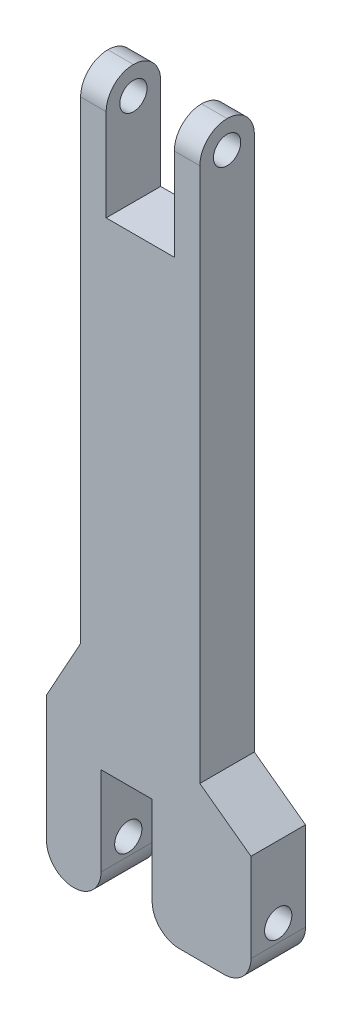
ISO-10303-21;
HEADER;
FILE_DESCRIPTION(('STEP AP214'),'2;1');
FILE_NAME('part.step','',(''),(''),'','','');
FILE_SCHEMA(('AUTOMOTIVE_DESIGN { 1 0 10303 214 1 1 1 1 }'));
ENDSEC;
DATA;
#1=APPLICATION_CONTEXT('core data for automotive mechanical design processes');
#2=APPLICATION_PROTOCOL_DEFINITION('international standard','automotive_design',2000,#1);
#3=PRODUCT_CONTEXT('',#1,'mechanical');
#4=PRODUCT('Part','Part','',(#3));
#5=PRODUCT_RELATED_PRODUCT_CATEGORY('part','',(#4));
#6=PRODUCT_DEFINITION_FORMATION('','',#4);
#7=PRODUCT_DEFINITION_CONTEXT('part definition',#1,'design');
#8=PRODUCT_DEFINITION('design','',#6,#7);
#9=PRODUCT_DEFINITION_SHAPE('','',#8);
#10=(LENGTH_UNIT() NAMED_UNIT(*) SI_UNIT(.MILLI.,.METRE.));
#11=(NAMED_UNIT(*) PLANE_ANGLE_UNIT() SI_UNIT($,.RADIAN.));
#12=(NAMED_UNIT(*) SI_UNIT($,.STERADIAN.) SOLID_ANGLE_UNIT());
#13=UNCERTAINTY_MEASURE_WITH_UNIT(LENGTH_MEASURE(1.E-05),#10,'distance_accuracy_value','');
#14=(GEOMETRIC_REPRESENTATION_CONTEXT(3) GLOBAL_UNCERTAINTY_ASSIGNED_CONTEXT((#13)) GLOBAL_UNIT_ASSIGNED_CONTEXT((#10,
#11,#12)) REPRESENTATION_CONTEXT('',''));
#15=CARTESIAN_POINT('',(0.,0.,0.));
#16=DIRECTION('',(0.,0.,1.));
#17=DIRECTION('',(1.,0.,0.));
#18=AXIS2_PLACEMENT_3D('',#15,#16,#17);
#19=CARTESIAN_POINT('',(0.,0.,11.));
#20=DIRECTION('',(0.,0.,1.));
#21=DIRECTION('',(1.,0.,0.));
#22=AXIS2_PLACEMENT_3D('',#19,#20,#21);
#23=PLANE('',#22);
#24=DIRECTION('',(0.,-1.,0.));
#25=VECTOR('',#24,1.);
#26=CARTESIAN_POINT('',(14.9999999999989,210.,11.));
#27=LINE('',#26,#25);
#28=CARTESIAN_POINT('',(14.9999999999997,97.5538967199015,11.));
#29=VERTEX_POINT('',#28);
#30=CARTESIAN_POINT('',(15.,61.79406940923,11.));
#31=VERTEX_POINT('',#30);
#32=EDGE_CURVE('E452',#29,#31,#27,.T.);
#33=ORIENTED_EDGE('',*,*,#32,.F.);
#34=DIRECTION('',(0.738238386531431,-0.674539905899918,0.));
#35=VECTOR('',#34,1.);
#36=CARTESIAN_POINT('',(55.4040973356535,60.6360440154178,11.));
#37=LINE('',#36,#35);
#38=CARTESIAN_POINT('',(40.,74.7110075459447,11.));
#39=VERTEX_POINT('',#38);
#40=EDGE_CURVE('E415',#29,#39,#37,.T.);
#41=ORIENTED_EDGE('',*,*,#40,.T.);
#42=DIRECTION('',(0.,1.,0.));
#43=VECTOR('',#42,1.);
#44=CARTESIAN_POINT('',(40.,45.,11.));
#45=LINE('',#44,#43);
#46=CARTESIAN_POINT('',(40.,68.5553908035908,11.));
#47=VERTEX_POINT('',#46);
#48=EDGE_CURVE('E790',#47,#39,#45,.T.);
#49=ORIENTED_EDGE('',*,*,#48,.F.);
#50=DIRECTION('',(-0.916480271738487,-0.400079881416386,0.));
#51=VECTOR('',#50,1.);
#52=CARTESIAN_POINT('',(-18.7343277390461,42.9155340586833,11.));
#53=LINE('',#52,#51);
#54=CARTESIAN_POINT('',(11.9734213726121,56.3206809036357,11.));
#55=VERTEX_POINT('',#54);
#56=EDGE_CURVE('E410',#47,#55,#53,.T.);
#57=ORIENTED_EDGE('',*,*,#56,.T.);
#58=DIRECTION('',(-0.483907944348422,-0.875118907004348,0.));
#59=VECTOR('',#58,1.);
#60=CARTESIAN_POINT('',(14.3755945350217,60.6648690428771,11.));
#61=LINE('',#60,#59);
#62=EDGE_CURVE('E445',#31,#55,#61,.T.);
#63=ORIENTED_EDGE('',*,*,#62,.F.);
#64=EDGE_LOOP('',(#33,#41,#49,#57,#63));
#65=FACE_BOUND('',#64,.T.);
#66=ADVANCED_FACE('F36',(#65),#23,.F.);
#67=DIRECTION('',(0.738238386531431,-0.674539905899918,0.));
#68=VECTOR('',#67,1.);
#69=CARTESIAN_POINT('',(92.4919839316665,101.226231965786,11.));
#70=LINE('',#69,#68);
#71=CARTESIAN_POINT('',(17.2237379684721,170.,11.));
#72=VERTEX_POINT('',#71);
#73=CARTESIAN_POINT('',(40.,149.188974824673,11.));
#74=VERTEX_POINT('',#73);
#75=EDGE_CURVE('E405',#72,#74,#70,.T.);
#76=ORIENTED_EDGE('',*,*,#75,.F.);
#77=DIRECTION('',(-1.,0.,0.));
#78=VECTOR('',#77,1.);
#79=CARTESIAN_POINT('',(37.499999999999,170.,11.));
#80=LINE('',#79,#78);
#81=CARTESIAN_POINT('',(40.,170.,11.));
#82=VERTEX_POINT('',#81);
#83=EDGE_CURVE('E455',#82,#72,#80,.T.);
#84=ORIENTED_EDGE('',*,*,#83,.F.);
#85=EDGE_CURVE('E465',#74,#82,#45,.T.);
#86=ORIENTED_EDGE('',*,*,#85,.F.);
#87=EDGE_LOOP('',(#76,#84,#86));
#88=FACE_BOUND('',#87,.T.);
#89=ADVANCED_FACE('F811',(#88),#23,.F.);
#90=DIRECTION('',(-0.674539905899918,-0.738238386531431,0.));
#91=VECTOR('',#90,1.);
#92=CARTESIAN_POINT('',(-43.0970231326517,39.3784209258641,11.));
#93=LINE('',#92,#91);
#94=CARTESIAN_POINT('',(40.,130.322502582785,11.));
#95=VERTEX_POINT('',#94);
#96=CARTESIAN_POINT('',(14.9999999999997,102.961690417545,11.));
#97=VERTEX_POINT('',#96);
#98=EDGE_CURVE('E400',#95,#97,#93,.T.);
#99=ORIENTED_EDGE('',*,*,#98,.F.);
#100=CARTESIAN_POINT('',(40.,78.774735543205,11.));
#101=VERTEX_POINT('',#100);
#102=EDGE_CURVE('E767',#101,#95,#45,.T.);
#103=ORIENTED_EDGE('',*,*,#102,.F.);
#104=DIRECTION('',(0.738238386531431,-0.674539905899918,0.));
#105=VECTOR('',#104,1.);
#106=CARTESIAN_POINT('',(57.4277170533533,62.8507591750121,11.));
#107=LINE('',#106,#105);
#108=CARTESIAN_POINT('',(14.9999999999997,101.617624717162,11.));
#109=VERTEX_POINT('',#108);
#110=EDGE_CURVE('E395',#109,#101,#107,.T.);
#111=ORIENTED_EDGE('',*,*,#110,.F.);
#112=EDGE_CURVE('E454',#97,#109,#27,.T.);
#113=ORIENTED_EDGE('',*,*,#112,.F.);
#114=EDGE_LOOP('',(#99,#103,#111,#113));
#115=FACE_BOUND('',#114,.T.);
#116=ADVANCED_FACE('F755',(#115),#23,.F.);
#117=CARTESIAN_POINT('',(14.9999999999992,167.96813600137,11.));
#118=VERTEX_POINT('',#117);
#119=CARTESIAN_POINT('',(14.9999999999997,107.409166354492,11.));
#120=VERTEX_POINT('',#119);
#121=EDGE_CURVE('E456',#118,#120,#27,.T.);
#122=ORIENTED_EDGE('',*,*,#121,.F.);
#123=DIRECTION('',(0.738238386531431,-0.674539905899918,0.));
#124=VECTOR('',#123,1.);
#125=CARTESIAN_POINT('',(90.4683642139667,99.0115168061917,11.));
#126=LINE('',#125,#124);
#127=CARTESIAN_POINT('',(40.,145.125246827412,11.));
#128=VERTEX_POINT('',#127);
#129=EDGE_CURVE('E425',#118,#128,#126,.T.);
#130=ORIENTED_EDGE('',*,*,#129,.T.);
#131=CARTESIAN_POINT('',(40.,134.769978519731,11.));
#132=VERTEX_POINT('',#131);
#133=EDGE_CURVE('E467',#132,#128,#45,.T.);
#134=ORIENTED_EDGE('',*,*,#133,.F.);
#135=DIRECTION('',(-0.674539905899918,-0.738238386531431,0.));
#136=VECTOR('',#135,1.);
#137=CARTESIAN_POINT('',(-45.311738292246,41.4020406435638,11.));
#138=LINE('',#137,#136);
#139=EDGE_CURVE('E420',#132,#120,#138,.T.);
#140=ORIENTED_EDGE('',*,*,#139,.T.);
#141=EDGE_LOOP('',(#122,#130,#134,#140));
#142=FACE_BOUND('',#141,.T.);
#143=ADVANCED_FACE('F789',(#142),#23,.F.);
#144=DIRECTION('',(-0.916480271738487,-0.400079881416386,0.));
#145=VECTOR('',#144,1.);
#146=CARTESIAN_POINT('',(-17.534088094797,40.1660932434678,11.));
#147=LINE('',#146,#145);
#148=CARTESIAN_POINT('',(40.,65.2819979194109,11.));
#149=VERTEX_POINT('',#148);
#150=CARTESIAN_POINT('',(11.5340716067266,52.8554944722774,11.));
#151=VERTEX_POINT('',#150);
#152=EDGE_CURVE('E370',#149,#151,#147,.T.);
#153=ORIENTED_EDGE('',*,*,#152,.F.);
#154=CARTESIAN_POINT('',(40.,44.3926508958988,11.));
#155=VERTEX_POINT('',#154);
#156=EDGE_CURVE('E468',#155,#149,#45,.T.);
#157=ORIENTED_EDGE('',*,*,#156,.F.);
#158=DIRECTION('',(0.958536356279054,-0.284970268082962,0.));
#159=VECTOR('',#158,1.);
#160=CARTESIAN_POINT('',(15.3743683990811,51.7137846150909,11.));
#161=LINE('',#160,#159);
#162=EDGE_CURVE('E53',#151,#155,#161,.T.);
#163=ORIENTED_EDGE('',*,*,#162,.F.);
#164=EDGE_LOOP('',(#153,#157,#163));
#165=FACE_BOUND('',#164,.T.);
#166=ADVANCED_FACE('F796',(#165),#23,.F.);
#167=CARTESIAN_POINT('',(14.3755945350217,60.6648690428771,16.));
#168=DIRECTION('',(0.875118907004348,-0.483907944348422,0.));
#169=DIRECTION('',(0.483907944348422,0.875118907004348,0.));
#170=AXIS2_PLACEMENT_3D('',#167,#168,#169);
#171=PLANE('',#170);
#172=DIRECTION('',(0.,0.,1.));
#173=VECTOR('',#172,1.);
#174=CARTESIAN_POINT('',(11.9734213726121,56.3206809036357,16.));
#175=LINE('',#174,#173);
#176=CARTESIAN_POINT('',(11.9734213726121,56.3206809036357,0.));
#177=VERTEX_POINT('',#176);
#178=EDGE_CURVE('E412',#177,#55,#175,.T.);
#179=ORIENTED_EDGE('',*,*,#178,.F.);
#180=DIRECTION('',(-0.483907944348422,-0.875118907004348,0.));
#181=VECTOR('',#180,1.);
#182=CARTESIAN_POINT('',(14.3755945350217,60.6648690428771,0.));
#183=LINE('',#182,#181);
#184=CARTESIAN_POINT('',(15.,61.79406940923,0.));
#185=VERTEX_POINT('',#184);
#186=EDGE_CURVE('E440',#185,#177,#183,.T.);
#187=ORIENTED_EDGE('',*,*,#186,.F.);
#188=DIRECTION('',(0.,0.,-1.));
#189=VECTOR('',#188,1.);
#190=CARTESIAN_POINT('',(15.,61.79406940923,16.));
#191=LINE('',#190,#189);
#192=EDGE_CURVE('E444',#31,#185,#191,.T.);
#193=ORIENTED_EDGE('',*,*,#192,.F.);
#194=ORIENTED_EDGE('',*,*,#62,.T.);
#195=EDGE_LOOP('',(#179,#187,#193,#194));
#196=FACE_BOUND('',#195,.T.);
#197=ADVANCED_FACE('F798',(#196),#171,.T.);
#198=CARTESIAN_POINT('',(14.9999999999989,210.,16.));
#199=DIRECTION('',(1.,0.,0.));
#200=DIRECTION('',(0.,1.,0.));
#201=AXIS2_PLACEMENT_3D('',#198,#199,#200);
#202=PLANE('',#201);
#203=DIRECTION('',(0.,-1.,0.));
#204=VECTOR('',#203,1.);
#205=CARTESIAN_POINT('',(14.9999999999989,210.,0.));
#206=LINE('',#205,#204);
#207=CARTESIAN_POINT('',(14.9999999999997,102.961690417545,0.));
#208=VERTEX_POINT('',#207);
#209=CARTESIAN_POINT('',(14.9999999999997,101.617624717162,0.));
#210=VERTEX_POINT('',#209);
#211=EDGE_CURVE('E496',#208,#210,#206,.T.);
#212=ORIENTED_EDGE('',*,*,#211,.F.);
#213=DIRECTION('',(0.,0.,1.));
#214=VECTOR('',#213,1.);
#215=CARTESIAN_POINT('',(14.9999999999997,102.961690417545,16.));
#216=LINE('',#215,#214);
#217=EDGE_CURVE('E403',#208,#97,#216,.T.);
#218=ORIENTED_EDGE('',*,*,#217,.T.);
#219=ORIENTED_EDGE('',*,*,#112,.T.);
#220=DIRECTION('',(0.,0.,-1.));
#221=VECTOR('',#220,1.);
#222=CARTESIAN_POINT('',(14.9999999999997,101.617624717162,16.));
#223=LINE('',#222,#221);
#224=EDGE_CURVE('E397',#109,#210,#223,.T.);
#225=ORIENTED_EDGE('',*,*,#224,.T.);
#226=EDGE_LOOP('',(#212,#218,#219,#225));
#227=FACE_BOUND('',#226,.T.);
#228=ADVANCED_FACE('F750',(#227),#202,.T.);
#229=DIRECTION('',(0.,0.,-1.));
#230=VECTOR('',#229,1.);
#231=CARTESIAN_POINT('',(14.9999999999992,167.96813600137,16.));
#232=LINE('',#231,#230);
#233=CARTESIAN_POINT('',(14.9999999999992,167.96813600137,0.));
#234=VERTEX_POINT('',#233);
#235=EDGE_CURVE('E428',#118,#234,#232,.T.);
#236=ORIENTED_EDGE('',*,*,#235,.F.);
#237=ORIENTED_EDGE('',*,*,#121,.T.);
#238=DIRECTION('',(0.,0.,1.));
#239=VECTOR('',#238,1.);
#240=CARTESIAN_POINT('',(14.9999999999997,107.409166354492,16.));
#241=LINE('',#240,#239);
#242=CARTESIAN_POINT('',(14.9999999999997,107.409166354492,0.));
#243=VERTEX_POINT('',#242);
#244=EDGE_CURVE('E422',#243,#120,#241,.T.);
#245=ORIENTED_EDGE('',*,*,#244,.F.);
#246=EDGE_CURVE('E498',#234,#243,#206,.T.);
#247=ORIENTED_EDGE('',*,*,#246,.F.);
#248=EDGE_LOOP('',(#236,#237,#245,#247));
#249=FACE_BOUND('',#248,.T.);
#250=ADVANCED_FACE('F839',(#249),#202,.T.);
#251=CARTESIAN_POINT('',(37.499999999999,170.,16.));
#252=DIRECTION('',(0.,-1.,0.));
#253=DIRECTION('',(1.,0.,0.));
#254=AXIS2_PLACEMENT_3D('',#251,#252,#253);
#255=PLANE('',#254);
#256=ORIENTED_EDGE('',*,*,#83,.T.);
#257=DIRECTION('',(0.,0.,-1.));
#258=VECTOR('',#257,1.);
#259=CARTESIAN_POINT('',(17.2237379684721,170.,16.));
#260=LINE('',#259,#258);
#261=CARTESIAN_POINT('',(17.2237379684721,170.,0.));
#262=VERTEX_POINT('',#261);
#263=EDGE_CURVE('E407',#72,#262,#260,.T.);
#264=ORIENTED_EDGE('',*,*,#263,.T.);
#265=DIRECTION('',(-1.,0.,0.));
#266=VECTOR('',#265,1.);
#267=CARTESIAN_POINT('',(37.499999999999,170.,0.));
#268=LINE('',#267,#266);
#269=CARTESIAN_POINT('',(40.,170.,0.));
#270=VERTEX_POINT('',#269);
#271=EDGE_CURVE('E497',#270,#262,#268,.T.);
#272=ORIENTED_EDGE('',*,*,#271,.F.);
#273=DIRECTION('',(0.,0.,-1.));
#274=VECTOR('',#273,1.);
#275=CARTESIAN_POINT('',(40.,170.,16.));
#276=LINE('',#275,#274);
#277=EDGE_CURVE('E523',#82,#270,#276,.T.);
#278=ORIENTED_EDGE('',*,*,#277,.F.);
#279=EDGE_LOOP('',(#256,#264,#272,#278));
#280=FACE_BOUND('',#279,.T.);
#281=ADVANCED_FACE('F889',(#280),#255,.T.);
#282=CARTESIAN_POINT('',(40.,45.,16.));
#283=DIRECTION('',(-1.,0.,0.));
#284=DIRECTION('',(0.,0.,1.));
#285=AXIS2_PLACEMENT_3D('',#282,#283,#284);
#286=PLANE('',#285);
#287=DIRECTION('',(0.,1.,0.));
#288=VECTOR('',#287,1.);
#289=CARTESIAN_POINT('',(40.,45.,0.));
#290=LINE('',#289,#288);
#291=CARTESIAN_POINT('',(40.,149.188974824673,0.));
#292=VERTEX_POINT('',#291);
#293=EDGE_CURVE('E501',#292,#270,#290,.T.);
#294=ORIENTED_EDGE('',*,*,#293,.F.);
#295=DIRECTION('',(0.,0.,1.));
#296=VECTOR('',#295,1.);
#297=CARTESIAN_POINT('',(40.,149.188974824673,16.));
#298=LINE('',#297,#296);
#299=EDGE_CURVE('E712',#292,#74,#298,.T.);
#300=ORIENTED_EDGE('',*,*,#299,.T.);
#301=ORIENTED_EDGE('',*,*,#85,.T.);
#302=ORIENTED_EDGE('',*,*,#277,.T.);
#303=EDGE_LOOP('',(#294,#300,#301,#302));
#304=FACE_BOUND('',#303,.T.);
#305=ADVANCED_FACE('F886',(#304),#286,.T.);
#306=ORIENTED_EDGE('',*,*,#102,.T.);
#307=DIRECTION('',(0.,0.,-1.));
#308=VECTOR('',#307,1.);
#309=CARTESIAN_POINT('',(40.,130.322502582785,16.));
#310=LINE('',#309,#308);
#311=CARTESIAN_POINT('',(40.,130.322502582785,0.));
#312=VERTEX_POINT('',#311);
#313=EDGE_CURVE('E715',#95,#312,#310,.T.);
#314=ORIENTED_EDGE('',*,*,#313,.T.);
#315=CARTESIAN_POINT('',(40.,78.774735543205,0.));
#316=VERTEX_POINT('',#315);
#317=EDGE_CURVE('E766',#316,#312,#290,.T.);
#318=ORIENTED_EDGE('',*,*,#317,.F.);
#319=DIRECTION('',(0.,0.,1.));
#320=VECTOR('',#319,1.);
#321=CARTESIAN_POINT('',(40.,78.774735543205,16.));
#322=LINE('',#321,#320);
#323=EDGE_CURVE('E717',#316,#101,#322,.T.);
#324=ORIENTED_EDGE('',*,*,#323,.T.);
#325=EDGE_LOOP('',(#306,#314,#318,#324));
#326=FACE_BOUND('',#325,.T.);
#327=ADVANCED_FACE('F765',(#326),#286,.T.);
#328=DIRECTION('',(0.,0.,1.));
#329=VECTOR('',#328,1.);
#330=CARTESIAN_POINT('',(40.,145.125246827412,16.));
#331=LINE('',#330,#329);
#332=CARTESIAN_POINT('',(40.,145.125246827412,0.));
#333=VERTEX_POINT('',#332);
#334=EDGE_CURVE('E11',#333,#128,#331,.T.);
#335=ORIENTED_EDGE('',*,*,#334,.F.);
#336=CARTESIAN_POINT('',(40.,134.769978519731,0.));
#337=VERTEX_POINT('',#336);
#338=EDGE_CURVE('E503',#337,#333,#290,.T.);
#339=ORIENTED_EDGE('',*,*,#338,.F.);
#340=DIRECTION('',(0.,0.,-1.));
#341=VECTOR('',#340,1.);
#342=CARTESIAN_POINT('',(40.,134.769978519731,16.));
#343=LINE('',#342,#341);
#344=EDGE_CURVE('E45',#132,#337,#343,.T.);
#345=ORIENTED_EDGE('',*,*,#344,.F.);
#346=ORIENTED_EDGE('',*,*,#133,.T.);
#347=EDGE_LOOP('',(#335,#339,#345,#346));
#348=FACE_BOUND('',#347,.T.);
#349=ADVANCED_FACE('F782',(#348),#286,.T.);
#350=ORIENTED_EDGE('',*,*,#156,.T.);
#351=DIRECTION('',(0.,0.,-1.));
#352=VECTOR('',#351,1.);
#353=CARTESIAN_POINT('',(40.,65.2819979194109,16.));
#354=LINE('',#353,#352);
#355=CARTESIAN_POINT('',(40.,65.2819979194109,0.));
#356=VERTEX_POINT('',#355);
#357=EDGE_CURVE('E720',#149,#356,#354,.T.);
#358=ORIENTED_EDGE('',*,*,#357,.T.);
#359=CARTESIAN_POINT('',(40.,44.3926508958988,0.));
#360=VERTEX_POINT('',#359);
#361=EDGE_CURVE('E362',#360,#356,#290,.T.);
#362=ORIENTED_EDGE('',*,*,#361,.F.);
#363=DIRECTION('',(0.,0.,1.));
#364=VECTOR('',#363,1.);
#365=CARTESIAN_POINT('',(40.,44.3926508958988,16.));
#366=LINE('',#365,#364);
#367=EDGE_CURVE('E375',#360,#155,#366,.T.);
#368=ORIENTED_EDGE('',*,*,#367,.T.);
#369=EDGE_LOOP('',(#350,#358,#362,#368));
#370=FACE_BOUND('',#369,.T.);
#371=ADVANCED_FACE('F795',(#370),#286,.T.);
#372=DIRECTION('',(0.,0.,1.));
#373=VECTOR('',#372,1.);
#374=CARTESIAN_POINT('',(40.,74.7110075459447,16.));
#375=LINE('',#374,#373);
#376=CARTESIAN_POINT('',(40.,74.7110075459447,0.));
#377=VERTEX_POINT('',#376);
#378=EDGE_CURVE('E707',#377,#39,#375,.T.);
#379=ORIENTED_EDGE('',*,*,#378,.F.);
#380=CARTESIAN_POINT('',(40.,68.5553908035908,0.));
#381=VERTEX_POINT('',#380);
#382=EDGE_CURVE('E770',#381,#377,#290,.T.);
#383=ORIENTED_EDGE('',*,*,#382,.F.);
#384=DIRECTION('',(0.,0.,-1.));
#385=VECTOR('',#384,1.);
#386=CARTESIAN_POINT('',(40.,68.5553908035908,16.));
#387=LINE('',#386,#385);
#388=EDGE_CURVE('E709',#47,#381,#387,.T.);
#389=ORIENTED_EDGE('',*,*,#388,.F.);
#390=ORIENTED_EDGE('',*,*,#48,.T.);
#391=EDGE_LOOP('',(#379,#383,#389,#390));
#392=FACE_BOUND('',#391,.T.);
#393=ADVANCED_FACE('F891',(#392),#286,.T.);
#394=CARTESIAN_POINT('',(0.,0.,0.));
#395=DIRECTION('',(0.,0.,1.));
#396=DIRECTION('',(1.,0.,0.));
#397=AXIS2_PLACEMENT_3D('',#394,#395,#396);
#398=PLANE('',#397);
#399=ORIENTED_EDGE('',*,*,#361,.T.);
#400=DIRECTION('',(-0.916480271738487,-0.400079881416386,0.));
#401=VECTOR('',#400,1.);
#402=CARTESIAN_POINT('',(47.8759131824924,68.7201454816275,0.));
#403=LINE('',#402,#401);
#404=CARTESIAN_POINT('',(11.5340716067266,52.8554944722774,0.));
#405=VERTEX_POINT('',#404);
#406=EDGE_CURVE('E356',#356,#405,#403,.T.);
#407=ORIENTED_EDGE('',*,*,#406,.T.);
#408=DIRECTION('',(0.958536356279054,-0.284970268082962,0.));
#409=VECTOR('',#408,1.);
#410=CARTESIAN_POINT('',(7.59872846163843,54.0254613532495,0.));
#411=LINE('',#410,#409);
#412=EDGE_CURVE('E361',#405,#360,#411,.T.);
#413=ORIENTED_EDGE('',*,*,#412,.T.);
#414=EDGE_LOOP('',(#399,#407,#413));
#415=FACE_BOUND('',#414,.T.);
#416=ORIENTED_EDGE('',*,*,#382,.T.);
#417=DIRECTION('',(0.738238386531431,-0.674539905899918,0.));
#418=VECTOR('',#417,1.);
#419=CARTESIAN_POINT('',(11.1997166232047,101.026274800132,0.));
#420=LINE('',#419,#418);
#421=CARTESIAN_POINT('',(14.9999999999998,97.5538967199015,0.));
#422=VERTEX_POINT('',#421);
#423=EDGE_CURVE('E832',#422,#377,#420,.T.);
#424=ORIENTED_EDGE('',*,*,#423,.F.);
#425=EDGE_CURVE('E494',#422,#185,#206,.T.);
#426=ORIENTED_EDGE('',*,*,#425,.T.);
#427=ORIENTED_EDGE('',*,*,#186,.T.);
#428=DIRECTION('',(-0.916480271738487,-0.400079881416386,0.));
#429=VECTOR('',#428,1.);
#430=CARTESIAN_POINT('',(46.6756735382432,71.469586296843,0.));
#431=LINE('',#430,#429);
#432=EDGE_CURVE('E827',#381,#177,#431,.T.);
#433=ORIENTED_EDGE('',*,*,#432,.F.);
#434=EDGE_LOOP('',(#416,#424,#426,#427,#433));
#435=FACE_BOUND('',#434,.T.);
#436=ORIENTED_EDGE('',*,*,#317,.T.);
#437=DIRECTION('',(-0.674539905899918,-0.738238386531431,0.));
#438=VECTOR('',#437,1.);
#439=CARTESIAN_POINT('',(48.3831509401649,139.497295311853,0.));
#440=LINE('',#439,#438);
#441=EDGE_CURVE('E381',#312,#208,#440,.T.);
#442=ORIENTED_EDGE('',*,*,#441,.T.);
#443=ORIENTED_EDGE('',*,*,#211,.T.);
#444=DIRECTION('',(0.738238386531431,-0.674539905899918,0.));
#445=VECTOR('',#444,1.);
#446=CARTESIAN_POINT('',(13.2233363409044,103.240989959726,0.));
#447=LINE('',#446,#445);
#448=EDGE_CURVE('E365',#210,#316,#447,.T.);
#449=ORIENTED_EDGE('',*,*,#448,.T.);
#450=EDGE_LOOP('',(#436,#442,#443,#449));
#451=FACE_BOUND('',#450,.T.);
#452=ORIENTED_EDGE('',*,*,#338,.T.);
#453=DIRECTION('',(0.738238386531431,-0.674539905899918,0.));
#454=VECTOR('',#453,1.);
#455=CARTESIAN_POINT('',(13.988190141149,168.892642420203,0.));
#456=LINE('',#455,#454);
#457=EDGE_CURVE('E391',#234,#333,#456,.T.);
#458=ORIENTED_EDGE('',*,*,#457,.F.);
#459=ORIENTED_EDGE('',*,*,#246,.T.);
#460=DIRECTION('',(-0.674539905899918,-0.738238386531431,0.));
#461=VECTOR('',#460,1.);
#462=CARTESIAN_POINT('',(46.1684357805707,141.520915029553,0.));
#463=LINE('',#462,#461);
#464=EDGE_CURVE('E779',#337,#243,#463,.T.);
#465=ORIENTED_EDGE('',*,*,#464,.F.);
#466=EDGE_LOOP('',(#452,#458,#459,#465));
#467=FACE_BOUND('',#466,.T.);
#468=ORIENTED_EDGE('',*,*,#271,.T.);
#469=DIRECTION('',(0.738238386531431,-0.674539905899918,0.));
#470=VECTOR('',#469,1.);
#471=CARTESIAN_POINT('',(16.0118098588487,171.107357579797,0.));
#472=LINE('',#471,#470);
#473=EDGE_CURVE('E384',#262,#292,#472,.T.);
#474=ORIENTED_EDGE('',*,*,#473,.T.);
#475=ORIENTED_EDGE('',*,*,#293,.T.);
#476=EDGE_LOOP('',(#468,#474,#475));
#477=FACE_BOUND('',#476,.T.);
#478=DIRECTION('',(-0.483907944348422,-0.875118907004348,0.));
#479=VECTOR('',#478,1.);
#480=CARTESIAN_POINT('',(10.,63.0844087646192,0.));
#481=LINE('',#480,#479);
#482=CARTESIAN_POINT('',(10.,63.0844087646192,0.));
#483=VERTEX_POINT('',#482);
#484=CARTESIAN_POINT('',(0.,45.,0.));
#485=VERTEX_POINT('',#484);
#486=EDGE_CURVE('E555',#483,#485,#481,.T.);
#487=ORIENTED_EDGE('',*,*,#486,.F.);
#488=DIRECTION('',(0.,-1.,0.));
#489=VECTOR('',#488,1.);
#490=CARTESIAN_POINT('',(9.99999999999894,210.,0.));
#491=LINE('',#490,#489);
#492=CARTESIAN_POINT('',(9.99999999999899,202.,0.));
#493=VERTEX_POINT('',#492);
#494=EDGE_CURVE('E610',#493,#483,#491,.T.);
#495=ORIENTED_EDGE('',*,*,#494,.F.);
#496=DIRECTION('',(-1.,0.,0.));
#497=VECTOR('',#496,1.);
#498=CARTESIAN_POINT('',(0.,202.,0.));
#499=LINE('',#498,#497);
#500=CARTESIAN_POINT('',(17.499999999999,202.,0.));
#501=VERTEX_POINT('',#500);
#502=EDGE_CURVE('E644',#493,#501,#499,.F.);
#503=ORIENTED_EDGE('',*,*,#502,.T.);
#504=DIRECTION('',(0.,1.,0.));
#505=VECTOR('',#504,1.);
#506=CARTESIAN_POINT('',(17.499999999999,210.,0.));
#507=LINE('',#506,#505);
#508=CARTESIAN_POINT('',(17.499999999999,175.,0.));
#509=VERTEX_POINT('',#508);
#510=EDGE_CURVE('E607',#509,#501,#507,.T.);
#511=ORIENTED_EDGE('',*,*,#510,.F.);
#512=DIRECTION('',(-1.,0.,0.));
#513=VECTOR('',#512,1.);
#514=CARTESIAN_POINT('',(37.4999999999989,175.,0.));
#515=LINE('',#514,#513);
#516=CARTESIAN_POINT('',(37.4999999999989,175.,0.));
#517=VERTEX_POINT('',#516);
#518=EDGE_CURVE('E605',#517,#509,#515,.T.);
#519=ORIENTED_EDGE('',*,*,#518,.F.);
#520=DIRECTION('',(0.,-1.,0.));
#521=VECTOR('',#520,1.);
#522=CARTESIAN_POINT('',(37.4999999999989,210.,0.));
#523=LINE('',#522,#521);
#524=CARTESIAN_POINT('',(37.4999999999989,202.,0.));
#525=VERTEX_POINT('',#524);
#526=EDGE_CURVE('E603',#525,#517,#523,.T.);
#527=ORIENTED_EDGE('',*,*,#526,.F.);
#528=DIRECTION('',(-1.,0.,0.));
#529=VECTOR('',#528,1.);
#530=CARTESIAN_POINT('',(0.,202.,0.));
#531=LINE('',#530,#529);
#532=CARTESIAN_POINT('',(45.,202.,0.));
#533=VERTEX_POINT('',#532);
#534=EDGE_CURVE('E641',#525,#533,#531,.F.);
#535=ORIENTED_EDGE('',*,*,#534,.T.);
#536=DIRECTION('',(0.,1.,0.));
#537=VECTOR('',#536,1.);
#538=CARTESIAN_POINT('',(45.,45.,0.));
#539=LINE('',#538,#537);
#540=CARTESIAN_POINT('',(45.,45.,0.));
#541=VERTEX_POINT('',#540);
#542=EDGE_CURVE('E601',#541,#533,#539,.T.);
#543=ORIENTED_EDGE('',*,*,#542,.F.);
#544=DIRECTION('',(-0.806404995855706,0.591363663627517,0.));
#545=VECTOR('',#544,1.);
#546=CARTESIAN_POINT('',(60.,34.,0.));
#547=LINE('',#546,#545);
#548=CARTESIAN_POINT('',(60.,34.,0.));
#549=VERTEX_POINT('',#548);
#550=EDGE_CURVE('E599',#549,#541,#547,.T.);
#551=ORIENTED_EDGE('',*,*,#550,.F.);
#552=DIRECTION('',(0.,1.,0.));
#553=VECTOR('',#552,1.);
#554=CARTESIAN_POINT('',(60.,0.,0.));
#555=LINE('',#554,#553);
#556=CARTESIAN_POINT('',(60.,8.,0.));
#557=VERTEX_POINT('',#556);
#558=EDGE_CURVE('E597',#557,#549,#555,.T.);
#559=ORIENTED_EDGE('',*,*,#558,.F.);
#560=CARTESIAN_POINT('',(52.,8.,0.));
#561=DIRECTION('',(0.,0.,1.));
#562=DIRECTION('',(1.,0.,0.));
#563=AXIS2_PLACEMENT_3D('',#560,#561,#562);
#564=CIRCLE('',#563,8.);
#565=CARTESIAN_POINT('',(52.,0.,0.));
#566=VERTEX_POINT('',#565);
#567=EDGE_CURVE('E647',#557,#566,#564,.F.);
#568=ORIENTED_EDGE('',*,*,#567,.T.);
#569=DIRECTION('',(1.,0.,0.));
#570=VECTOR('',#569,1.);
#571=CARTESIAN_POINT('',(31.,0.,0.));
#572=LINE('',#571,#570);
#573=CARTESIAN_POINT('',(39.,0.,0.));
#574=VERTEX_POINT('',#573);
#575=EDGE_CURVE('E594',#574,#566,#572,.T.);
#576=ORIENTED_EDGE('',*,*,#575,.F.);
#577=CARTESIAN_POINT('',(39.,8.,0.));
#578=DIRECTION('',(0.,0.,1.));
#579=DIRECTION('',(1.,0.,0.));
#580=AXIS2_PLACEMENT_3D('',#577,#578,#579);
#581=CIRCLE('',#580,8.);
#582=CARTESIAN_POINT('',(31.,8.,0.));
#583=VERTEX_POINT('',#582);
#584=EDGE_CURVE('E653',#574,#583,#581,.F.);
#585=ORIENTED_EDGE('',*,*,#584,.T.);
#586=DIRECTION('',(0.,-1.,0.));
#587=VECTOR('',#586,1.);
#588=CARTESIAN_POINT('',(31.,34.,0.));
#589=LINE('',#588,#587);
#590=CARTESIAN_POINT('',(31.,34.,0.));
#591=VERTEX_POINT('',#590);
#592=EDGE_CURVE('E591',#591,#583,#589,.T.);
#593=ORIENTED_EDGE('',*,*,#592,.F.);
#594=DIRECTION('',(1.,0.,0.));
#595=VECTOR('',#594,1.);
#596=CARTESIAN_POINT('',(16.,34.,0.));
#597=LINE('',#596,#595);
#598=CARTESIAN_POINT('',(16.,34.,0.));
#599=VERTEX_POINT('',#598);
#600=EDGE_CURVE('E589',#599,#591,#597,.T.);
#601=ORIENTED_EDGE('',*,*,#600,.F.);
#602=DIRECTION('',(0.,1.,0.));
#603=VECTOR('',#602,1.);
#604=CARTESIAN_POINT('',(16.,0.,0.));
#605=LINE('',#604,#603);
#606=CARTESIAN_POINT('',(16.,8.,0.));
#607=VERTEX_POINT('',#606);
#608=EDGE_CURVE('E586',#607,#599,#605,.T.);
#609=ORIENTED_EDGE('',*,*,#608,.F.);
#610=CARTESIAN_POINT('',(8.00000000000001,8.,0.));
#611=DIRECTION('',(0.,0.,1.));
#612=DIRECTION('',(1.,0.,0.));
#613=AXIS2_PLACEMENT_3D('',#610,#611,#612);
#614=CIRCLE('',#613,8.);
#615=CARTESIAN_POINT('',(8.,0.,0.));
#616=VERTEX_POINT('',#615);
#617=EDGE_CURVE('E651',#607,#616,#614,.F.);
#618=ORIENTED_EDGE('',*,*,#617,.T.);
#619=CARTESIAN_POINT('',(8.,8.,0.));
#620=DIRECTION('',(0.,0.,1.));
#621=DIRECTION('',(1.,0.,0.));
#622=AXIS2_PLACEMENT_3D('',#619,#620,#621);
#623=CIRCLE('',#622,8.);
#624=CARTESIAN_POINT('',(0.,8.00000000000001,0.));
#625=VERTEX_POINT('',#624);
#626=EDGE_CURVE('E649',#616,#625,#623,.F.);
#627=ORIENTED_EDGE('',*,*,#626,.T.);
#628=DIRECTION('',(0.,-1.,0.));
#629=VECTOR('',#628,1.);
#630=CARTESIAN_POINT('',(0.,45.,0.));
#631=LINE('',#630,#629);
#632=EDGE_CURVE('E583',#485,#625,#631,.T.);
#633=ORIENTED_EDGE('',*,*,#632,.F.);
#634=EDGE_LOOP('',(#487,#495,#503,#511,#519,#527,#535,#543,#551,#559,#568,#576,#585,#593,#601,
#609,#618,#627,#633));
#635=FACE_BOUND('',#634,.T.);
#636=DIRECTION('',(0.958536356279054,-0.284970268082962,0.));
#637=VECTOR('',#636,1.);
#638=CARTESIAN_POINT('',(6.74381765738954,51.1498522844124,0.));
#639=LINE('',#638,#637);
#640=CARTESIAN_POINT('',(8.77949358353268,50.5446513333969,0.));
#641=VERTEX_POINT('',#640);
#642=CARTESIAN_POINT('',(42.7599303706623,40.4423593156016,0.));
#643=VERTEX_POINT('',#642);
#644=EDGE_CURVE('E387',#641,#643,#639,.T.);
#645=ORIENTED_EDGE('',*,*,#644,.F.);
#646=CARTESIAN_POINT('',(5.,43.7096606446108,0.));
#647=VERTEX_POINT('',#646);
#648=EDGE_CURVE('E493',#641,#647,#183,.T.);
#649=ORIENTED_EDGE('',*,*,#648,.T.);
#650=DIRECTION('',(0.,-1.,0.));
#651=VECTOR('',#650,1.);
#652=CARTESIAN_POINT('',(5.,45.,0.));
#653=LINE('',#652,#651);
#654=CARTESIAN_POINT('',(5.,17.1231056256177,0.));
#655=VERTEX_POINT('',#654);
#656=EDGE_CURVE('E434',#647,#655,#653,.T.);
#657=ORIENTED_EDGE('',*,*,#656,.T.);
#658=DIRECTION('',(-1.,0.,0.));
#659=VECTOR('',#658,1.);
#660=CARTESIAN_POINT('',(84.,17.1231056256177,0.));
#661=LINE('',#660,#659);
#662=CARTESIAN_POINT('',(11.,17.1231056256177,0.));
#663=VERTEX_POINT('',#662);
#664=EDGE_CURVE('E520',#655,#663,#661,.F.);
#665=ORIENTED_EDGE('',*,*,#664,.T.);
#666=DIRECTION('',(0.,1.,0.));
#667=VECTOR('',#666,1.);
#668=CARTESIAN_POINT('',(11.,0.,0.));
#669=LINE('',#668,#667);
#670=CARTESIAN_POINT('',(11.,39.,0.));
#671=VERTEX_POINT('',#670);
#672=EDGE_CURVE('E490',#663,#671,#669,.T.);
#673=ORIENTED_EDGE('',*,*,#672,.T.);
#674=DIRECTION('',(1.,0.,0.));
#675=VECTOR('',#674,1.);
#676=CARTESIAN_POINT('',(16.,39.,0.));
#677=LINE('',#676,#675);
#678=CARTESIAN_POINT('',(36.,39.,0.));
#679=VERTEX_POINT('',#678);
#680=EDGE_CURVE('E513',#671,#679,#677,.T.);
#681=ORIENTED_EDGE('',*,*,#680,.T.);
#682=DIRECTION('',(0.,-1.,0.));
#683=VECTOR('',#682,1.);
#684=CARTESIAN_POINT('',(36.,34.,0.));
#685=LINE('',#684,#683);
#686=CARTESIAN_POINT('',(36.,17.1231056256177,0.));
#687=VERTEX_POINT('',#686);
#688=EDGE_CURVE('E510',#679,#687,#685,.T.);
#689=ORIENTED_EDGE('',*,*,#688,.T.);
#690=DIRECTION('',(-1.,0.,0.));
#691=VECTOR('',#690,1.);
#692=CARTESIAN_POINT('',(84.,17.1231056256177,0.));
#693=LINE('',#692,#691);
#694=CARTESIAN_POINT('',(55.,17.1231056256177,0.));
#695=VERTEX_POINT('',#694);
#696=EDGE_CURVE('E480',#687,#695,#693,.F.);
#697=ORIENTED_EDGE('',*,*,#696,.T.);
#698=DIRECTION('',(0.,1.,0.));
#699=VECTOR('',#698,1.);
#700=CARTESIAN_POINT('',(55.,0.,0.));
#701=LINE('',#700,#699);
#702=CARTESIAN_POINT('',(55.,31.4663082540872,0.));
#703=VERTEX_POINT('',#702);
#704=EDGE_CURVE('E507',#695,#703,#701,.T.);
#705=ORIENTED_EDGE('',*,*,#704,.T.);
#706=DIRECTION('',(-0.806404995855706,0.591363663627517,0.));
#707=VECTOR('',#706,1.);
#708=CARTESIAN_POINT('',(57.0431816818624,29.9679750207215,0.));
#709=LINE('',#708,#707);
#710=EDGE_CURVE('E504',#703,#643,#709,.T.);
#711=ORIENTED_EDGE('',*,*,#710,.T.);
#712=EDGE_LOOP('',(#645,#649,#657,#665,#673,#681,#689,#697,#705,#711));
#713=FACE_BOUND('',#712,.T.);
#714=ADVANCED_FACE('F358',(#415,#435,#451,#467,#477,#635,#713),#398,.F.);
#715=CARTESIAN_POINT('',(0.,45.,16.));
#716=DIRECTION('',(1.,0.,0.));
#717=DIRECTION('',(0.,1.,0.));
#718=AXIS2_PLACEMENT_3D('',#715,#716,#717);
#719=PLANE('',#718);
#720=CARTESIAN_POINT('',(0.,13.,8.));
#721=DIRECTION('',(1.,0.,0.));
#722=DIRECTION('',(0.,1.,0.));
#723=AXIS2_PLACEMENT_3D('',#720,#721,#722);
#724=CIRCLE('',#723,4.);
#725=CARTESIAN_POINT('',(0.,17.,8.));
#726=VERTEX_POINT('',#725);
#727=EDGE_CURVE('E547',#726,#726,#724,.F.);
#728=ORIENTED_EDGE('',*,*,#727,.F.);
#729=EDGE_LOOP('',(#728));
#730=FACE_BOUND('',#729,.T.);
#731=ORIENTED_EDGE('',*,*,#632,.T.);
#732=DIRECTION('',(0.,0.,-1.));
#733=VECTOR('',#732,1.);
#734=CARTESIAN_POINT('',(0.,8.,16.));
#735=LINE('',#734,#733);
#736=CARTESIAN_POINT('',(0.,8.00000000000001,16.));
#737=VERTEX_POINT('',#736);
#738=EDGE_CURVE('E672',#625,#737,#735,.F.);
#739=ORIENTED_EDGE('',*,*,#738,.T.);
#740=DIRECTION('',(0.,-1.,0.));
#741=VECTOR('',#740,1.);
#742=CARTESIAN_POINT('',(0.,45.,16.));
#743=LINE('',#742,#741);
#744=CARTESIAN_POINT('',(0.,45.,16.));
#745=VERTEX_POINT('',#744);
#746=EDGE_CURVE('E551',#745,#737,#743,.T.);
#747=ORIENTED_EDGE('',*,*,#746,.F.);
#748=DIRECTION('',(0.,0.,-1.));
#749=VECTOR('',#748,1.);
#750=CARTESIAN_POINT('',(0.,45.,16.));
#751=LINE('',#750,#749);
#752=EDGE_CURVE('E582',#745,#485,#751,.T.);
#753=ORIENTED_EDGE('',*,*,#752,.T.);
#754=EDGE_LOOP('',(#731,#739,#747,#753));
#755=FACE_BOUND('',#754,.T.);
#756=ADVANCED_FACE('F1036',(#730,#755),#719,.F.);
#757=CARTESIAN_POINT('',(16.,0.,16.));
#758=DIRECTION('',(-1.,0.,0.));
#759=DIRECTION('',(0.,0.,1.));
#760=AXIS2_PLACEMENT_3D('',#757,#758,#759);
#761=PLANE('',#760);
#762=CARTESIAN_POINT('',(16.,13.,8.));
#763=DIRECTION('',(-1.,0.,0.));
#764=DIRECTION('',(0.,0.,1.));
#765=AXIS2_PLACEMENT_3D('',#762,#763,#764);
#766=CIRCLE('',#765,4.);
#767=CARTESIAN_POINT('',(16.,13.,12.));
#768=VERTEX_POINT('',#767);
#769=EDGE_CURVE('E544',#768,#768,#766,.F.);
#770=ORIENTED_EDGE('',*,*,#769,.F.);
#771=EDGE_LOOP('',(#770));
#772=FACE_BOUND('',#771,.T.);
#773=DIRECTION('',(0.,1.,0.));
#774=VECTOR('',#773,1.);
#775=CARTESIAN_POINT('',(16.,0.,16.));
#776=LINE('',#775,#774);
#777=CARTESIAN_POINT('',(16.,8.,16.));
#778=VERTEX_POINT('',#777);
#779=CARTESIAN_POINT('',(16.,34.,16.));
#780=VERTEX_POINT('',#779);
#781=EDGE_CURVE('E554',#778,#780,#776,.T.);
#782=ORIENTED_EDGE('',*,*,#781,.F.);
#783=DIRECTION('',(0.,0.,-1.));
#784=VECTOR('',#783,1.);
#785=CARTESIAN_POINT('',(16.,8.,16.));
#786=LINE('',#785,#784);
#787=EDGE_CURVE('E669',#778,#607,#786,.T.);
#788=ORIENTED_EDGE('',*,*,#787,.T.);
#789=ORIENTED_EDGE('',*,*,#608,.T.);
#790=DIRECTION('',(0.,0.,-1.));
#791=VECTOR('',#790,1.);
#792=CARTESIAN_POINT('',(16.,34.,16.));
#793=LINE('',#792,#791);
#794=EDGE_CURVE('E633',#780,#599,#793,.T.);
#795=ORIENTED_EDGE('',*,*,#794,.F.);
#796=EDGE_LOOP('',(#782,#788,#789,#795));
#797=FACE_BOUND('',#796,.T.);
#798=ADVANCED_FACE('F1192',(#772,#797),#761,.F.);
#799=CARTESIAN_POINT('',(16.,34.,16.));
#800=DIRECTION('',(0.,1.,0.));
#801=DIRECTION('',(0.,0.,1.));
#802=AXIS2_PLACEMENT_3D('',#799,#800,#801);
#803=PLANE('',#802);
#804=ORIENTED_EDGE('',*,*,#600,.T.);
#805=DIRECTION('',(0.,0.,-1.));
#806=VECTOR('',#805,1.);
#807=CARTESIAN_POINT('',(31.,34.,16.));
#808=LINE('',#807,#806);
#809=CARTESIAN_POINT('',(31.,34.,16.));
#810=VERTEX_POINT('',#809);
#811=EDGE_CURVE('E630',#810,#591,#808,.T.);
#812=ORIENTED_EDGE('',*,*,#811,.F.);
#813=DIRECTION('',(1.,0.,0.));
#814=VECTOR('',#813,1.);
#815=CARTESIAN_POINT('',(16.,34.,16.));
#816=LINE('',#815,#814);
#817=EDGE_CURVE('E557',#780,#810,#816,.T.);
#818=ORIENTED_EDGE('',*,*,#817,.F.);
#819=ORIENTED_EDGE('',*,*,#794,.T.);
#820=EDGE_LOOP('',(#804,#812,#818,#819));
#821=FACE_BOUND('',#820,.T.);
#822=ADVANCED_FACE('F1184',(#821),#803,.F.);
#823=CARTESIAN_POINT('',(31.,34.,16.));
#824=DIRECTION('',(1.,0.,0.));
#825=DIRECTION('',(0.,1.,0.));
#826=AXIS2_PLACEMENT_3D('',#823,#824,#825);
#827=PLANE('',#826);
#828=CARTESIAN_POINT('',(31.,13.,8.));
#829=DIRECTION('',(1.,0.,0.));
#830=DIRECTION('',(0.,1.,0.));
#831=AXIS2_PLACEMENT_3D('',#828,#829,#830);
#832=CIRCLE('',#831,4.);
#833=CARTESIAN_POINT('',(31.,17.,8.));
#834=VERTEX_POINT('',#833);
#835=EDGE_CURVE('E541',#834,#834,#832,.F.);
#836=ORIENTED_EDGE('',*,*,#835,.F.);
#837=EDGE_LOOP('',(#836));
#838=FACE_BOUND('',#837,.T.);
#839=ORIENTED_EDGE('',*,*,#592,.T.);
#840=DIRECTION('',(0.,0.,-1.));
#841=VECTOR('',#840,1.);
#842=CARTESIAN_POINT('',(31.,8.,16.));
#843=LINE('',#842,#841);
#844=CARTESIAN_POINT('',(31.,8.,16.));
#845=VERTEX_POINT('',#844);
#846=EDGE_CURVE('E655',#583,#845,#843,.F.);
#847=ORIENTED_EDGE('',*,*,#846,.T.);
#848=DIRECTION('',(0.,-1.,0.));
#849=VECTOR('',#848,1.);
#850=CARTESIAN_POINT('',(31.,34.,16.));
#851=LINE('',#850,#849);
#852=EDGE_CURVE('E559',#810,#845,#851,.T.);
#853=ORIENTED_EDGE('',*,*,#852,.F.);
#854=ORIENTED_EDGE('',*,*,#811,.T.);
#855=EDGE_LOOP('',(#839,#847,#853,#854));
#856=FACE_BOUND('',#855,.T.);
#857=ADVANCED_FACE('F1179',(#838,#856),#827,.F.);
#858=CARTESIAN_POINT('',(31.,0.,16.));
#859=DIRECTION('',(0.,1.,0.));
#860=DIRECTION('',(0.,0.,1.));
#861=AXIS2_PLACEMENT_3D('',#858,#859,#860);
#862=PLANE('',#861);
#863=DIRECTION('',(1.,0.,0.));
#864=VECTOR('',#863,1.);
#865=CARTESIAN_POINT('',(31.,0.,16.));
#866=LINE('',#865,#864);
#867=CARTESIAN_POINT('',(39.,0.,16.));
#868=VERTEX_POINT('',#867);
#869=CARTESIAN_POINT('',(52.,0.,16.));
#870=VERTEX_POINT('',#869);
#871=EDGE_CURVE('E562',#868,#870,#866,.T.);
#872=ORIENTED_EDGE('',*,*,#871,.F.);
#873=DIRECTION('',(0.,0.,-1.));
#874=VECTOR('',#873,1.);
#875=CARTESIAN_POINT('',(39.,0.,16.));
#876=LINE('',#875,#874);
#877=EDGE_CURVE('E638',#868,#574,#876,.T.);
#878=ORIENTED_EDGE('',*,*,#877,.T.);
#879=ORIENTED_EDGE('',*,*,#575,.T.);
#880=DIRECTION('',(0.,0.,-1.));
#881=VECTOR('',#880,1.);
#882=CARTESIAN_POINT('',(52.,0.,16.));
#883=LINE('',#882,#881);
#884=EDGE_CURVE('E636',#566,#870,#883,.F.);
#885=ORIENTED_EDGE('',*,*,#884,.T.);
#886=EDGE_LOOP('',(#872,#878,#879,#885));
#887=FACE_BOUND('',#886,.T.);
#888=ADVANCED_FACE('F1171',(#887),#862,.F.);
#889=CARTESIAN_POINT('',(60.,0.,16.));
#890=DIRECTION('',(-1.,0.,0.));
#891=DIRECTION('',(0.,0.,1.));
#892=AXIS2_PLACEMENT_3D('',#889,#890,#891);
#893=PLANE('',#892);
#894=CARTESIAN_POINT('',(60.,13.,8.));
#895=DIRECTION('',(-1.,0.,0.));
#896=DIRECTION('',(0.,0.,1.));
#897=AXIS2_PLACEMENT_3D('',#894,#895,#896);
#898=CIRCLE('',#897,4.);
#899=CARTESIAN_POINT('',(60.,13.,12.));
#900=VERTEX_POINT('',#899);
#901=EDGE_CURVE('E540',#900,#900,#898,.F.);
#902=ORIENTED_EDGE('',*,*,#901,.F.);
#903=EDGE_LOOP('',(#902));
#904=FACE_BOUND('',#903,.T.);
#905=DIRECTION('',(0.,1.,0.));
#906=VECTOR('',#905,1.);
#907=CARTESIAN_POINT('',(60.,0.,16.));
#908=LINE('',#907,#906);
#909=CARTESIAN_POINT('',(60.,8.,16.));
#910=VERTEX_POINT('',#909);
#911=CARTESIAN_POINT('',(60.,34.,16.));
#912=VERTEX_POINT('',#911);
#913=EDGE_CURVE('E565',#910,#912,#908,.T.);
#914=ORIENTED_EDGE('',*,*,#913,.F.);
#915=DIRECTION('',(0.,0.,-1.));
#916=VECTOR('',#915,1.);
#917=CARTESIAN_POINT('',(60.,8.,16.));
#918=LINE('',#917,#916);
#919=EDGE_CURVE('E674',#910,#557,#918,.T.);
#920=ORIENTED_EDGE('',*,*,#919,.T.);
#921=ORIENTED_EDGE('',*,*,#558,.T.);
#922=DIRECTION('',(0.,0.,-1.));
#923=VECTOR('',#922,1.);
#924=CARTESIAN_POINT('',(60.,34.,16.));
#925=LINE('',#924,#923);
#926=EDGE_CURVE('E627',#912,#549,#925,.T.);
#927=ORIENTED_EDGE('',*,*,#926,.F.);
#928=EDGE_LOOP('',(#914,#920,#921,#927));
#929=FACE_BOUND('',#928,.T.);
#930=ADVANCED_FACE('F1050',(#904,#929),#893,.F.);
#931=CARTESIAN_POINT('',(60.,34.,16.));
#932=DIRECTION('',(-0.591363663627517,-0.806404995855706,0.));
#933=DIRECTION('',(0.806404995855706,-0.591363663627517,0.));
#934=AXIS2_PLACEMENT_3D('',#931,#932,#933);
#935=PLANE('',#934);
#936=ORIENTED_EDGE('',*,*,#550,.T.);
#937=DIRECTION('',(0.,0.,-1.));
#938=VECTOR('',#937,1.);
#939=CARTESIAN_POINT('',(45.,45.,16.));
#940=LINE('',#939,#938);
#941=CARTESIAN_POINT('',(45.,45.,16.));
#942=VERTEX_POINT('',#941);
#943=EDGE_CURVE('E624',#942,#541,#940,.T.);
#944=ORIENTED_EDGE('',*,*,#943,.F.);
#945=DIRECTION('',(-0.806404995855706,0.591363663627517,0.));
#946=VECTOR('',#945,1.);
#947=CARTESIAN_POINT('',(60.,34.,16.));
#948=LINE('',#947,#946);
#949=EDGE_CURVE('E567',#912,#942,#948,.T.);
#950=ORIENTED_EDGE('',*,*,#949,.F.);
#951=ORIENTED_EDGE('',*,*,#926,.T.);
#952=EDGE_LOOP('',(#936,#944,#950,#951));
#953=FACE_BOUND('',#952,.T.);
#954=ADVANCED_FACE('F1044',(#953),#935,.F.);
#955=CARTESIAN_POINT('',(45.,45.,16.));
#956=DIRECTION('',(-1.,0.,0.));
#957=DIRECTION('',(0.,0.,1.));
#958=AXIS2_PLACEMENT_3D('',#955,#956,#957);
#959=PLANE('',#958);
#960=ORIENTED_EDGE('',*,*,#542,.T.);
#961=CARTESIAN_POINT('',(45.,202.,8.));
#962=DIRECTION('',(-1.,0.,0.));
#963=DIRECTION('',(0.,0.,1.));
#964=AXIS2_PLACEMENT_3D('',#961,#962,#963);
#965=CIRCLE('',#964,8.);
#966=CARTESIAN_POINT('',(45.,210.,8.));
#967=VERTEX_POINT('',#966);
#968=EDGE_CURVE('E692',#533,#967,#965,.F.);
#969=ORIENTED_EDGE('',*,*,#968,.T.);
#970=CARTESIAN_POINT('',(45.,202.,8.));
#971=DIRECTION('',(-1.,0.,0.));
#972=DIRECTION('',(0.,0.,1.));
#973=AXIS2_PLACEMENT_3D('',#970,#971,#972);
#974=CIRCLE('',#973,8.);
#975=CARTESIAN_POINT('',(45.,202.,16.));
#976=VERTEX_POINT('',#975);
#977=EDGE_CURVE('E689',#967,#976,#974,.F.);
#978=ORIENTED_EDGE('',*,*,#977,.T.);
#979=DIRECTION('',(0.,1.,0.));
#980=VECTOR('',#979,1.);
#981=CARTESIAN_POINT('',(45.,45.,16.));
#982=LINE('',#981,#980);
#983=EDGE_CURVE('E569',#942,#976,#982,.T.);
#984=ORIENTED_EDGE('',*,*,#983,.F.);
#985=ORIENTED_EDGE('',*,*,#943,.T.);
#986=EDGE_LOOP('',(#960,#969,#978,#984,#985));
#987=FACE_BOUND('',#986,.T.);
#988=CARTESIAN_POINT('',(45.,202.,8.));
#989=DIRECTION('',(1.,0.,0.));
#990=DIRECTION('',(0.,0.,-1.));
#991=AXIS2_PLACEMENT_3D('',#988,#989,#990);
#992=CIRCLE('',#991,3.99999999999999);
#993=CARTESIAN_POINT('',(45.,202.,4.00000000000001));
#994=VERTEX_POINT('',#993);
#995=EDGE_CURVE('E530',#994,#994,#992,.T.);
#996=ORIENTED_EDGE('',*,*,#995,.F.);
#997=EDGE_LOOP('',(#996));
#998=FACE_BOUND('',#997,.T.);
#999=ADVANCED_FACE('F1049',(#987,#998),#959,.F.);
#1000=CARTESIAN_POINT('',(37.4999999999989,210.,16.));
#1001=DIRECTION('',(1.,0.,0.));
#1002=DIRECTION('',(0.,1.,0.));
#1003=AXIS2_PLACEMENT_3D('',#1000,#1001,#1002);
#1004=PLANE('',#1003);
#1005=CARTESIAN_POINT('',(37.4999999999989,202.,8.));
#1006=DIRECTION('',(1.,0.,0.));
#1007=DIRECTION('',(0.,1.,0.));
#1008=AXIS2_PLACEMENT_3D('',#1005,#1006,#1007);
#1009=CIRCLE('',#1008,3.99999999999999);
#1010=CARTESIAN_POINT('',(37.4999999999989,206.,8.));
#1011=VERTEX_POINT('',#1010);
#1012=EDGE_CURVE('E537',#1011,#1011,#1009,.T.);
#1013=ORIENTED_EDGE('',*,*,#1012,.T.);
#1014=EDGE_LOOP('',(#1013));
#1015=FACE_BOUND('',#1014,.T.);
#1016=CARTESIAN_POINT('',(37.4999999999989,202.,8.));
#1017=DIRECTION('',(1.,0.,0.));
#1018=DIRECTION('',(0.,1.,0.));
#1019=AXIS2_PLACEMENT_3D('',#1016,#1017,#1018);
#1020=CIRCLE('',#1019,8.);
#1021=CARTESIAN_POINT('',(37.4999999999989,202.,16.));
#1022=VERTEX_POINT('',#1021);
#1023=CARTESIAN_POINT('',(37.4999999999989,210.,8.));
#1024=VERTEX_POINT('',#1023);
#1025=EDGE_CURVE('E685',#1022,#1024,#1020,.F.);
#1026=ORIENTED_EDGE('',*,*,#1025,.T.);
#1027=CARTESIAN_POINT('',(37.4999999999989,202.,8.));
#1028=DIRECTION('',(1.,0.,0.));
#1029=DIRECTION('',(0.,1.,0.));
#1030=AXIS2_PLACEMENT_3D('',#1027,#1028,#1029);
#1031=CIRCLE('',#1030,8.);
#1032=EDGE_CURVE('E687',#1024,#525,#1031,.F.);
#1033=ORIENTED_EDGE('',*,*,#1032,.T.);
#1034=ORIENTED_EDGE('',*,*,#526,.T.);
#1035=DIRECTION('',(0.,0.,-1.));
#1036=VECTOR('',#1035,1.);
#1037=CARTESIAN_POINT('',(37.4999999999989,175.,16.));
#1038=LINE('',#1037,#1036);
#1039=CARTESIAN_POINT('',(37.4999999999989,175.,16.));
#1040=VERTEX_POINT('',#1039);
#1041=EDGE_CURVE('E621',#1040,#517,#1038,.T.);
#1042=ORIENTED_EDGE('',*,*,#1041,.F.);
#1043=DIRECTION('',(0.,-1.,0.));
#1044=VECTOR('',#1043,1.);
#1045=CARTESIAN_POINT('',(37.4999999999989,210.,16.));
#1046=LINE('',#1045,#1044);
#1047=EDGE_CURVE('E571',#1022,#1040,#1046,.T.);
#1048=ORIENTED_EDGE('',*,*,#1047,.F.);
#1049=EDGE_LOOP('',(#1026,#1033,#1034,#1042,#1048));
#1050=FACE_BOUND('',#1049,.T.);
#1051=ADVANCED_FACE('F1062',(#1015,#1050),#1004,.F.);
#1052=CARTESIAN_POINT('',(37.4999999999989,175.,16.));
#1053=DIRECTION('',(0.,-1.,0.));
#1054=DIRECTION('',(1.,0.,0.));
#1055=AXIS2_PLACEMENT_3D('',#1052,#1053,#1054);
#1056=PLANE('',#1055);
#1057=ORIENTED_EDGE('',*,*,#518,.T.);
#1058=DIRECTION('',(0.,0.,-1.));
#1059=VECTOR('',#1058,1.);
#1060=CARTESIAN_POINT('',(17.499999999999,175.,16.));
#1061=LINE('',#1060,#1059);
#1062=CARTESIAN_POINT('',(17.499999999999,175.,16.));
#1063=VERTEX_POINT('',#1062);
#1064=EDGE_CURVE('E618',#1063,#509,#1061,.T.);
#1065=ORIENTED_EDGE('',*,*,#1064,.F.);
#1066=DIRECTION('',(-1.,0.,0.));
#1067=VECTOR('',#1066,1.);
#1068=CARTESIAN_POINT('',(37.4999999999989,175.,16.));
#1069=LINE('',#1068,#1067);
#1070=EDGE_CURVE('E573',#1040,#1063,#1069,.T.);
#1071=ORIENTED_EDGE('',*,*,#1070,.F.);
#1072=ORIENTED_EDGE('',*,*,#1041,.T.);
#1073=EDGE_LOOP('',(#1057,#1065,#1071,#1072));
#1074=FACE_BOUND('',#1073,.T.);
#1075=ADVANCED_FACE('F1135',(#1074),#1056,.F.);
#1076=CARTESIAN_POINT('',(17.499999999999,210.,16.));
#1077=DIRECTION('',(-1.,0.,0.));
#1078=DIRECTION('',(0.,-1.,0.));
#1079=AXIS2_PLACEMENT_3D('',#1076,#1077,#1078);
#1080=PLANE('',#1079);
#1081=CARTESIAN_POINT('',(17.4999999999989,202.,8.));
#1082=DIRECTION('',(-1.,0.,0.));
#1083=DIRECTION('',(0.,-1.,0.));
#1084=AXIS2_PLACEMENT_3D('',#1081,#1082,#1083);
#1085=CIRCLE('',#1084,3.99999999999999);
#1086=CARTESIAN_POINT('',(17.4999999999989,198.,8.));
#1087=VERTEX_POINT('',#1086);
#1088=EDGE_CURVE('E534',#1087,#1087,#1085,.T.);
#1089=ORIENTED_EDGE('',*,*,#1088,.T.);
#1090=EDGE_LOOP('',(#1089));
#1091=FACE_BOUND('',#1090,.T.);
#1092=ORIENTED_EDGE('',*,*,#510,.T.);
#1093=CARTESIAN_POINT('',(17.499999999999,202.,8.));
#1094=DIRECTION('',(-1.,0.,0.));
#1095=DIRECTION('',(0.,-1.,0.));
#1096=AXIS2_PLACEMENT_3D('',#1093,#1094,#1095);
#1097=CIRCLE('',#1096,8.);
#1098=CARTESIAN_POINT('',(17.499999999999,210.,8.));
#1099=VERTEX_POINT('',#1098);
#1100=EDGE_CURVE('E683',#501,#1099,#1097,.F.);
#1101=ORIENTED_EDGE('',*,*,#1100,.T.);
#1102=CARTESIAN_POINT('',(17.499999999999,202.,8.));
#1103=DIRECTION('',(-1.,0.,0.));
#1104=DIRECTION('',(0.,-1.,0.));
#1105=AXIS2_PLACEMENT_3D('',#1102,#1103,#1104);
#1106=CIRCLE('',#1105,8.);
#1107=CARTESIAN_POINT('',(17.499999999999,202.,16.));
#1108=VERTEX_POINT('',#1107);
#1109=EDGE_CURVE('E681',#1099,#1108,#1106,.F.);
#1110=ORIENTED_EDGE('',*,*,#1109,.T.);
#1111=DIRECTION('',(0.,1.,0.));
#1112=VECTOR('',#1111,1.);
#1113=CARTESIAN_POINT('',(17.499999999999,210.,16.));
#1114=LINE('',#1113,#1112);
#1115=EDGE_CURVE('E575',#1063,#1108,#1114,.T.);
#1116=ORIENTED_EDGE('',*,*,#1115,.F.);
#1117=ORIENTED_EDGE('',*,*,#1064,.T.);
#1118=EDGE_LOOP('',(#1092,#1101,#1110,#1116,#1117));
#1119=FACE_BOUND('',#1118,.T.);
#1120=ADVANCED_FACE('F1076',(#1091,#1119),#1080,.F.);
#1121=CARTESIAN_POINT('',(9.99999999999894,210.,16.));
#1122=DIRECTION('',(1.,0.,0.));
#1123=DIRECTION('',(0.,1.,0.));
#1124=AXIS2_PLACEMENT_3D('',#1121,#1122,#1123);
#1125=PLANE('',#1124);
#1126=CARTESIAN_POINT('',(9.99999999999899,202.,8.));
#1127=DIRECTION('',(1.,0.,0.));
#1128=DIRECTION('',(0.,1.,0.));
#1129=AXIS2_PLACEMENT_3D('',#1126,#1127,#1128);
#1130=CIRCLE('',#1129,3.99999999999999);
#1131=CARTESIAN_POINT('',(9.99999999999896,206.,8.));
#1132=VERTEX_POINT('',#1131);
#1133=EDGE_CURVE('E533',#1132,#1132,#1130,.T.);
#1134=ORIENTED_EDGE('',*,*,#1133,.T.);
#1135=EDGE_LOOP('',(#1134));
#1136=FACE_BOUND('',#1135,.T.);
#1137=ORIENTED_EDGE('',*,*,#494,.T.);
#1138=DIRECTION('',(0.,0.,-1.));
#1139=VECTOR('',#1138,1.);
#1140=CARTESIAN_POINT('',(10.,63.0844087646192,16.));
#1141=LINE('',#1140,#1139);
#1142=CARTESIAN_POINT('',(10.,63.0844087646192,16.));
#1143=VERTEX_POINT('',#1142);
#1144=EDGE_CURVE('E615',#1143,#483,#1141,.T.);
#1145=ORIENTED_EDGE('',*,*,#1144,.F.);
#1146=DIRECTION('',(0.,-1.,0.));
#1147=VECTOR('',#1146,1.);
#1148=CARTESIAN_POINT('',(9.99999999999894,210.,16.));
#1149=LINE('',#1148,#1147);
#1150=CARTESIAN_POINT('',(9.99999999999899,202.,16.));
#1151=VERTEX_POINT('',#1150);
#1152=EDGE_CURVE('E578',#1151,#1143,#1149,.T.);
#1153=ORIENTED_EDGE('',*,*,#1152,.F.);
#1154=CARTESIAN_POINT('',(9.99999999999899,202.,8.));
#1155=DIRECTION('',(1.,0.,0.));
#1156=DIRECTION('',(0.,1.,0.));
#1157=AXIS2_PLACEMENT_3D('',#1154,#1155,#1156);
#1158=CIRCLE('',#1157,8.);
#1159=CARTESIAN_POINT('',(9.99999999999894,210.,8.));
#1160=VERTEX_POINT('',#1159);
#1161=EDGE_CURVE('E677',#1151,#1160,#1158,.F.);
#1162=ORIENTED_EDGE('',*,*,#1161,.T.);
#1163=CARTESIAN_POINT('',(9.99999999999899,202.,8.));
#1164=DIRECTION('',(1.,0.,0.));
#1165=DIRECTION('',(0.,1.,0.));
#1166=AXIS2_PLACEMENT_3D('',#1163,#1164,#1165);
#1167=CIRCLE('',#1166,8.);
#1168=EDGE_CURVE('E679',#1160,#493,#1167,.F.);
#1169=ORIENTED_EDGE('',*,*,#1168,.T.);
#1170=EDGE_LOOP('',(#1137,#1145,#1153,#1162,#1169));
#1171=FACE_BOUND('',#1170,.T.);
#1172=ADVANCED_FACE('F1070',(#1136,#1171),#1125,.F.);
#1173=CARTESIAN_POINT('',(10.,63.0844087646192,16.));
#1174=DIRECTION('',(0.875118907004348,-0.483907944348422,0.));
#1175=DIRECTION('',(0.483907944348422,0.875118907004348,0.));
#1176=AXIS2_PLACEMENT_3D('',#1173,#1174,#1175);
#1177=PLANE('',#1176);
#1178=ORIENTED_EDGE('',*,*,#752,.F.);
#1179=DIRECTION('',(-0.483907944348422,-0.875118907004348,0.));
#1180=VECTOR('',#1179,1.);
#1181=CARTESIAN_POINT('',(10.,63.0844087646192,16.));
#1182=LINE('',#1181,#1180);
#1183=EDGE_CURVE('E580',#1143,#745,#1182,.T.);
#1184=ORIENTED_EDGE('',*,*,#1183,.F.);
#1185=ORIENTED_EDGE('',*,*,#1144,.T.);
#1186=ORIENTED_EDGE('',*,*,#486,.T.);
#1187=EDGE_LOOP('',(#1178,#1184,#1185,#1186));
#1188=FACE_BOUND('',#1187,.T.);
#1189=ADVANCED_FACE('F1075',(#1188),#1177,.F.);
#1190=CARTESIAN_POINT('',(0.,0.,16.));
#1191=DIRECTION('',(0.,0.,1.));
#1192=DIRECTION('',(1.,0.,0.));
#1193=AXIS2_PLACEMENT_3D('',#1190,#1191,#1192);
#1194=PLANE('',#1193);
#1195=ORIENTED_EDGE('',*,*,#1152,.T.);
#1196=ORIENTED_EDGE('',*,*,#1183,.T.);
#1197=ORIENTED_EDGE('',*,*,#746,.T.);
#1198=CARTESIAN_POINT('',(8.,8.,16.));
#1199=DIRECTION('',(0.,0.,1.));
#1200=DIRECTION('',(1.,0.,0.));
#1201=AXIS2_PLACEMENT_3D('',#1198,#1199,#1200);
#1202=CIRCLE('',#1201,8.);
#1203=CARTESIAN_POINT('',(8.,0.,16.));
#1204=VERTEX_POINT('',#1203);
#1205=EDGE_CURVE('E663',#737,#1204,#1202,.T.);
#1206=ORIENTED_EDGE('',*,*,#1205,.T.);
#1207=CARTESIAN_POINT('',(8.00000000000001,8.,16.));
#1208=DIRECTION('',(0.,0.,1.));
#1209=DIRECTION('',(1.,0.,0.));
#1210=AXIS2_PLACEMENT_3D('',#1207,#1208,#1209);
#1211=CIRCLE('',#1210,8.);
#1212=EDGE_CURVE('E665',#1204,#778,#1211,.T.);
#1213=ORIENTED_EDGE('',*,*,#1212,.T.);
#1214=ORIENTED_EDGE('',*,*,#781,.T.);
#1215=ORIENTED_EDGE('',*,*,#817,.T.);
#1216=ORIENTED_EDGE('',*,*,#852,.T.);
#1217=CARTESIAN_POINT('',(39.,8.,16.));
#1218=DIRECTION('',(0.,0.,1.));
#1219=DIRECTION('',(1.,0.,0.));
#1220=AXIS2_PLACEMENT_3D('',#1217,#1218,#1219);
#1221=CIRCLE('',#1220,8.);
#1222=EDGE_CURVE('E667',#845,#868,#1221,.T.);
#1223=ORIENTED_EDGE('',*,*,#1222,.T.);
#1224=ORIENTED_EDGE('',*,*,#871,.T.);
#1225=CARTESIAN_POINT('',(52.,8.,16.));
#1226=DIRECTION('',(0.,0.,1.));
#1227=DIRECTION('',(1.,0.,0.));
#1228=AXIS2_PLACEMENT_3D('',#1225,#1226,#1227);
#1229=CIRCLE('',#1228,8.);
#1230=EDGE_CURVE('E661',#870,#910,#1229,.T.);
#1231=ORIENTED_EDGE('',*,*,#1230,.T.);
#1232=ORIENTED_EDGE('',*,*,#913,.T.);
#1233=ORIENTED_EDGE('',*,*,#949,.T.);
#1234=ORIENTED_EDGE('',*,*,#983,.T.);
#1235=DIRECTION('',(-1.,0.,0.));
#1236=VECTOR('',#1235,1.);
#1237=CARTESIAN_POINT('',(37.4999999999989,202.,16.));
#1238=LINE('',#1237,#1236);
#1239=EDGE_CURVE('E657',#976,#1022,#1238,.T.);
#1240=ORIENTED_EDGE('',*,*,#1239,.T.);
#1241=ORIENTED_EDGE('',*,*,#1047,.T.);
#1242=ORIENTED_EDGE('',*,*,#1070,.T.);
#1243=ORIENTED_EDGE('',*,*,#1115,.T.);
#1244=DIRECTION('',(-1.,0.,0.));
#1245=VECTOR('',#1244,1.);
#1246=CARTESIAN_POINT('',(9.99999999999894,202.,16.));
#1247=LINE('',#1246,#1245);
#1248=EDGE_CURVE('E659',#1108,#1151,#1247,.T.);
#1249=ORIENTED_EDGE('',*,*,#1248,.T.);
#1250=EDGE_LOOP('',(#1195,#1196,#1197,#1206,#1213,#1214,#1215,#1216,#1223,#1224,#1231,#1232,
#1233,#1234,#1240,#1241,#1242,#1243,#1249));
#1251=FACE_BOUND('',#1250,.T.);
#1252=ADVANCED_FACE('F1088',(#1251),#1194,.T.);
#1253=CARTESIAN_POINT('',(39.,8.,16.));
#1254=DIRECTION('',(0.,0.,-1.));
#1255=DIRECTION('',(-1.,0.,0.));
#1256=AXIS2_PLACEMENT_3D('',#1253,#1254,#1255);
#1257=CYLINDRICAL_SURFACE('',#1256,8.);
#1258=ORIENTED_EDGE('',*,*,#1222,.F.);
#1259=ORIENTED_EDGE('',*,*,#846,.F.);
#1260=ORIENTED_EDGE('',*,*,#584,.F.);
#1261=ORIENTED_EDGE('',*,*,#877,.F.);
#1262=EDGE_LOOP('',(#1258,#1259,#1260,#1261));
#1263=FACE_BOUND('',#1262,.T.);
#1264=ADVANCED_FACE('F1097',(#1263),#1257,.T.);
#1265=CARTESIAN_POINT('',(8.,8.,16.));
#1266=DIRECTION('',(0.,0.,-1.));
#1267=DIRECTION('',(-1.,0.,0.));
#1268=AXIS2_PLACEMENT_3D('',#1265,#1266,#1267);
#1269=CYLINDRICAL_SURFACE('',#1268,8.);
#1270=DIRECTION('',(0.,0.,-1.));
#1271=VECTOR('',#1270,1.);
#1272=CARTESIAN_POINT('',(8.,0.,16.));
#1273=LINE('',#1272,#1271);
#1274=EDGE_CURVE('E587',#1204,#616,#1273,.T.);
#1275=ORIENTED_EDGE('',*,*,#1274,.F.);
#1276=ORIENTED_EDGE('',*,*,#1205,.F.);
#1277=ORIENTED_EDGE('',*,*,#738,.F.);
#1278=ORIENTED_EDGE('',*,*,#626,.F.);
#1279=EDGE_LOOP('',(#1275,#1276,#1277,#1278));
#1280=FACE_BOUND('',#1279,.T.);
#1281=ADVANCED_FACE('F1259',(#1280),#1269,.T.);
#1282=CARTESIAN_POINT('',(8.00000000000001,8.,16.));
#1283=DIRECTION('',(0.,0.,-1.));
#1284=DIRECTION('',(-1.,0.,0.));
#1285=AXIS2_PLACEMENT_3D('',#1282,#1283,#1284);
#1286=CYLINDRICAL_SURFACE('',#1285,8.);
#1287=ORIENTED_EDGE('',*,*,#1212,.F.);
#1288=ORIENTED_EDGE('',*,*,#1274,.T.);
#1289=ORIENTED_EDGE('',*,*,#617,.F.);
#1290=ORIENTED_EDGE('',*,*,#787,.F.);
#1291=EDGE_LOOP('',(#1287,#1288,#1289,#1290));
#1292=FACE_BOUND('',#1291,.T.);
#1293=ADVANCED_FACE('F1249',(#1292),#1286,.T.);
#1294=CARTESIAN_POINT('',(52.,8.,16.));
#1295=DIRECTION('',(0.,0.,-1.));
#1296=DIRECTION('',(-1.,0.,0.));
#1297=AXIS2_PLACEMENT_3D('',#1294,#1295,#1296);
#1298=CYLINDRICAL_SURFACE('',#1297,8.);
#1299=ORIENTED_EDGE('',*,*,#1230,.F.);
#1300=ORIENTED_EDGE('',*,*,#884,.F.);
#1301=ORIENTED_EDGE('',*,*,#567,.F.);
#1302=ORIENTED_EDGE('',*,*,#919,.F.);
#1303=EDGE_LOOP('',(#1299,#1300,#1301,#1302));
#1304=FACE_BOUND('',#1303,.T.);
#1305=ADVANCED_FACE('F1239',(#1304),#1298,.T.);
#1306=CARTESIAN_POINT('',(0.,202.,8.));
#1307=DIRECTION('',(1.,0.,0.));
#1308=DIRECTION('',(0.,0.,-1.));
#1309=AXIS2_PLACEMENT_3D('',#1306,#1307,#1308);
#1310=CYLINDRICAL_SURFACE('',#1309,8.);
#1311=ORIENTED_EDGE('',*,*,#1248,.F.);
#1312=ORIENTED_EDGE('',*,*,#1109,.F.);
#1313=DIRECTION('',(-1.,0.,0.));
#1314=VECTOR('',#1313,1.);
#1315=CARTESIAN_POINT('',(17.499999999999,210.,8.));
#1316=LINE('',#1315,#1314);
#1317=EDGE_CURVE('E696',#1160,#1099,#1316,.F.);
#1318=ORIENTED_EDGE('',*,*,#1317,.F.);
#1319=ORIENTED_EDGE('',*,*,#1161,.F.);
#1320=EDGE_LOOP('',(#1311,#1312,#1318,#1319));
#1321=FACE_BOUND('',#1320,.T.);
#1322=ADVANCED_FACE('F1229',(#1321),#1310,.T.);
#1323=CARTESIAN_POINT('',(9.99999999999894,202.,8.));
#1324=DIRECTION('',(-1.,0.,0.));
#1325=DIRECTION('',(0.,0.,1.));
#1326=AXIS2_PLACEMENT_3D('',#1323,#1324,#1325);
#1327=CYLINDRICAL_SURFACE('',#1326,8.);
#1328=ORIENTED_EDGE('',*,*,#1100,.F.);
#1329=ORIENTED_EDGE('',*,*,#502,.F.);
#1330=ORIENTED_EDGE('',*,*,#1168,.F.);
#1331=ORIENTED_EDGE('',*,*,#1317,.T.);
#1332=EDGE_LOOP('',(#1328,#1329,#1330,#1331));
#1333=FACE_BOUND('',#1332,.T.);
#1334=ADVANCED_FACE('F1220',(#1333),#1327,.T.);
#1335=CARTESIAN_POINT('',(0.,202.,8.));
#1336=DIRECTION('',(1.,0.,0.));
#1337=DIRECTION('',(0.,0.,-1.));
#1338=AXIS2_PLACEMENT_3D('',#1335,#1336,#1337);
#1339=CYLINDRICAL_SURFACE('',#1338,8.);
#1340=ORIENTED_EDGE('',*,*,#1239,.F.);
#1341=ORIENTED_EDGE('',*,*,#977,.F.);
#1342=DIRECTION('',(-1.,0.,0.));
#1343=VECTOR('',#1342,1.);
#1344=CARTESIAN_POINT('',(45.,210.,8.));
#1345=LINE('',#1344,#1343);
#1346=EDGE_CURVE('E550',#1024,#967,#1345,.F.);
#1347=ORIENTED_EDGE('',*,*,#1346,.F.);
#1348=ORIENTED_EDGE('',*,*,#1025,.F.);
#1349=EDGE_LOOP('',(#1340,#1341,#1347,#1348));
#1350=FACE_BOUND('',#1349,.T.);
#1351=ADVANCED_FACE('F38',(#1350),#1339,.T.);
#1352=CARTESIAN_POINT('',(45.,202.,8.));
#1353=DIRECTION('',(-1.,0.,0.));
#1354=DIRECTION('',(0.,0.,1.));
#1355=AXIS2_PLACEMENT_3D('',#1352,#1353,#1354);
#1356=CYLINDRICAL_SURFACE('',#1355,8.);
#1357=ORIENTED_EDGE('',*,*,#968,.F.);
#1358=ORIENTED_EDGE('',*,*,#534,.F.);
#1359=ORIENTED_EDGE('',*,*,#1032,.F.);
#1360=ORIENTED_EDGE('',*,*,#1346,.T.);
#1361=EDGE_LOOP('',(#1357,#1358,#1359,#1360));
#1362=FACE_BOUND('',#1361,.T.);
#1363=ADVANCED_FACE('F1162',(#1362),#1356,.T.);
#1364=CARTESIAN_POINT('',(84.,13.,8.));
#1365=DIRECTION('',(-1.,0.,0.));
#1366=DIRECTION('',(0.,0.,1.));
#1367=AXIS2_PLACEMENT_3D('',#1364,#1365,#1366);
#1368=CYLINDRICAL_SURFACE('',#1367,4.);
#1369=ORIENTED_EDGE('',*,*,#901,.T.);
#1370=EDGE_LOOP('',(#1369));
#1371=FACE_BOUND('',#1370,.T.);
#1372=ORIENTED_EDGE('',*,*,#835,.T.);
#1373=EDGE_LOOP('',(#1372));
#1374=FACE_BOUND('',#1373,.T.);
#1375=ADVANCED_FACE('F1152',(#1371,#1374),#1368,.F.);
#1376=ORIENTED_EDGE('',*,*,#769,.T.);
#1377=EDGE_LOOP('',(#1376));
#1378=FACE_BOUND('',#1377,.T.);
#1379=ORIENTED_EDGE('',*,*,#727,.T.);
#1380=EDGE_LOOP('',(#1379));
#1381=FACE_BOUND('',#1380,.T.);
#1382=ADVANCED_FACE('F1126',(#1378,#1381),#1368,.F.);
#1383=CARTESIAN_POINT('',(-19.,202.,8.));
#1384=DIRECTION('',(1.,0.,0.));
#1385=DIRECTION('',(0.,0.,-1.));
#1386=AXIS2_PLACEMENT_3D('',#1383,#1384,#1385);
#1387=CYLINDRICAL_SURFACE('',#1386,3.99999999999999);
#1388=ORIENTED_EDGE('',*,*,#1133,.F.);
#1389=EDGE_LOOP('',(#1388));
#1390=FACE_BOUND('',#1389,.T.);
#1391=ORIENTED_EDGE('',*,*,#1088,.F.);
#1392=EDGE_LOOP('',(#1391));
#1393=FACE_BOUND('',#1392,.T.);
#1394=ADVANCED_FACE('F865',(#1390,#1393),#1387,.F.);
#1395=ORIENTED_EDGE('',*,*,#995,.T.);
#1396=EDGE_LOOP('',(#1395));
#1397=FACE_BOUND('',#1396,.T.);
#1398=ORIENTED_EDGE('',*,*,#1012,.F.);
#1399=EDGE_LOOP('',(#1398));
#1400=FACE_BOUND('',#1399,.T.);
#1401=ADVANCED_FACE('F861',(#1397,#1400),#1387,.F.);
#1402=CARTESIAN_POINT('',(84.,13.,8.));
#1403=DIRECTION('',(-1.,0.,0.));
#1404=DIRECTION('',(0.,0.,1.));
#1405=AXIS2_PLACEMENT_3D('',#1402,#1403,#1404);
#1406=CYLINDRICAL_SURFACE('',#1405,9.);
#1407=CARTESIAN_POINT('',(55.,13.,8.));
#1408=DIRECTION('',(-1.,0.,0.));
#1409=DIRECTION('',(0.,0.,1.));
#1410=AXIS2_PLACEMENT_3D('',#1407,#1408,#1409);
#1411=CIRCLE('',#1410,9.);
#1412=CARTESIAN_POINT('',(55.,21.4852813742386,11.));
#1413=VERTEX_POINT('',#1412);
#1414=EDGE_CURVE('E430',#695,#1413,#1411,.F.);
#1415=ORIENTED_EDGE('',*,*,#1414,.F.);
#1416=ORIENTED_EDGE('',*,*,#696,.F.);
#1417=CARTESIAN_POINT('',(36.,13.,8.));
#1418=DIRECTION('',(1.,0.,0.));
#1419=DIRECTION('',(0.,1.,0.));
#1420=AXIS2_PLACEMENT_3D('',#1417,#1418,#1419);
#1421=CIRCLE('',#1420,9.);
#1422=CARTESIAN_POINT('',(36.,21.4852813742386,11.));
#1423=VERTEX_POINT('',#1422);
#1424=EDGE_CURVE('E476',#1423,#687,#1421,.F.);
#1425=ORIENTED_EDGE('',*,*,#1424,.F.);
#1426=DIRECTION('',(-1.,0.,0.));
#1427=VECTOR('',#1426,1.);
#1428=CARTESIAN_POINT('',(84.,21.4852813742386,11.));
#1429=LINE('',#1428,#1427);
#1430=EDGE_CURVE('E528',#1413,#1423,#1429,.T.);
#1431=ORIENTED_EDGE('',*,*,#1430,.F.);
#1432=EDGE_LOOP('',(#1415,#1416,#1425,#1431));
#1433=FACE_BOUND('',#1432,.T.);
#1434=ADVANCED_FACE('F809',(#1433),#1406,.T.);
#1435=CARTESIAN_POINT('',(8.77949358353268,50.5446513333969,11.));
#1436=VERTEX_POINT('',#1435);
#1437=CARTESIAN_POINT('',(5.,43.7096606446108,11.));
#1438=VERTEX_POINT('',#1437);
#1439=EDGE_CURVE('E448',#1436,#1438,#61,.T.);
#1440=ORIENTED_EDGE('',*,*,#1439,.F.);
#1441=DIRECTION('',(0.958536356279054,-0.284970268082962,0.));
#1442=VECTOR('',#1441,1.);
#1443=CARTESIAN_POINT('',(14.5194575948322,48.8381755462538,11.));
#1444=LINE('',#1443,#1442);
#1445=CARTESIAN_POINT('',(42.7599303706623,40.4423593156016,11.));
#1446=VERTEX_POINT('',#1445);
#1447=EDGE_CURVE('E388',#1436,#1446,#1444,.T.);
#1448=ORIENTED_EDGE('',*,*,#1447,.T.);
#1449=DIRECTION('',(-0.806404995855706,0.591363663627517,0.));
#1450=VECTOR('',#1449,1.);
#1451=CARTESIAN_POINT('',(57.0431816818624,29.9679750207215,11.));
#1452=LINE('',#1451,#1450);
#1453=CARTESIAN_POINT('',(55.,31.4663082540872,11.));
#1454=VERTEX_POINT('',#1453);
#1455=EDGE_CURVE('E463',#1454,#1446,#1452,.T.);
#1456=ORIENTED_EDGE('',*,*,#1455,.F.);
#1457=DIRECTION('',(0.,1.,0.));
#1458=VECTOR('',#1457,1.);
#1459=CARTESIAN_POINT('',(55.,0.,11.));
#1460=LINE('',#1459,#1458);
#1461=EDGE_CURVE('E460',#1413,#1454,#1460,.T.);
#1462=ORIENTED_EDGE('',*,*,#1461,.F.);
#1463=ORIENTED_EDGE('',*,*,#1430,.T.);
#1464=DIRECTION('',(0.,-1.,0.));
#1465=VECTOR('',#1464,1.);
#1466=CARTESIAN_POINT('',(36.,34.,11.));
#1467=LINE('',#1466,#1465);
#1468=CARTESIAN_POINT('',(36.,39.,11.));
#1469=VERTEX_POINT('',#1468);
#1470=EDGE_CURVE('E457',#1469,#1423,#1467,.T.);
#1471=ORIENTED_EDGE('',*,*,#1470,.F.);
#1472=DIRECTION('',(1.,0.,0.));
#1473=VECTOR('',#1472,1.);
#1474=CARTESIAN_POINT('',(16.,39.,11.));
#1475=LINE('',#1474,#1473);
#1476=CARTESIAN_POINT('',(11.,39.,11.));
#1477=VERTEX_POINT('',#1476);
#1478=EDGE_CURVE('E461',#1477,#1469,#1475,.T.);
#1479=ORIENTED_EDGE('',*,*,#1478,.F.);
#1480=DIRECTION('',(0.,1.,0.));
#1481=VECTOR('',#1480,1.);
#1482=CARTESIAN_POINT('',(11.,0.,11.));
#1483=LINE('',#1482,#1481);
#1484=CARTESIAN_POINT('',(11.,21.4852813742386,11.));
#1485=VERTEX_POINT('',#1484);
#1486=EDGE_CURVE('E439',#1485,#1477,#1483,.T.);
#1487=ORIENTED_EDGE('',*,*,#1486,.F.);
#1488=DIRECTION('',(-1.,0.,0.));
#1489=VECTOR('',#1488,1.);
#1490=CARTESIAN_POINT('',(84.,21.4852813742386,11.));
#1491=LINE('',#1490,#1489);
#1492=CARTESIAN_POINT('',(5.,21.4852813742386,11.));
#1493=VERTEX_POINT('',#1492);
#1494=EDGE_CURVE('E526',#1493,#1485,#1491,.F.);
#1495=ORIENTED_EDGE('',*,*,#1494,.F.);
#1496=DIRECTION('',(0.,-1.,0.));
#1497=VECTOR('',#1496,1.);
#1498=CARTESIAN_POINT('',(5.,45.,11.));
#1499=LINE('',#1498,#1497);
#1500=EDGE_CURVE('E436',#1438,#1493,#1499,.T.);
#1501=ORIENTED_EDGE('',*,*,#1500,.F.);
#1502=EDGE_LOOP('',(#1440,#1448,#1456,#1462,#1463,#1471,#1479,#1487,#1495,#1501));
#1503=FACE_BOUND('',#1502,.T.);
#1504=ADVANCED_FACE('F740',(#1503),#23,.F.);
#1505=DIRECTION('',(0.,0.,-1.));
#1506=VECTOR('',#1505,1.);
#1507=CARTESIAN_POINT('',(8.77949358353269,50.5446513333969,16.));
#1508=LINE('',#1507,#1506);
#1509=EDGE_CURVE('E61',#1436,#641,#1508,.T.);
#1510=ORIENTED_EDGE('',*,*,#1509,.F.);
#1511=ORIENTED_EDGE('',*,*,#1439,.T.);
#1512=DIRECTION('',(0.,0.,-1.));
#1513=VECTOR('',#1512,1.);
#1514=CARTESIAN_POINT('',(5.,43.7096606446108,16.));
#1515=LINE('',#1514,#1513);
#1516=EDGE_CURVE('E441',#1438,#647,#1515,.T.);
#1517=ORIENTED_EDGE('',*,*,#1516,.T.);
#1518=ORIENTED_EDGE('',*,*,#648,.F.);
#1519=EDGE_LOOP('',(#1510,#1511,#1517,#1518));
#1520=FACE_BOUND('',#1519,.T.);
#1521=ADVANCED_FACE('F806',(#1520),#171,.T.);
#1522=DIRECTION('',(0.,0.,-1.));
#1523=VECTOR('',#1522,1.);
#1524=CARTESIAN_POINT('',(14.9999999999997,97.5538967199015,16.));
#1525=LINE('',#1524,#1523);
#1526=EDGE_CURVE('E418',#29,#422,#1525,.T.);
#1527=ORIENTED_EDGE('',*,*,#1526,.F.);
#1528=ORIENTED_EDGE('',*,*,#32,.T.);
#1529=ORIENTED_EDGE('',*,*,#192,.T.);
#1530=ORIENTED_EDGE('',*,*,#425,.F.);
#1531=EDGE_LOOP('',(#1527,#1528,#1529,#1530));
#1532=FACE_BOUND('',#1531,.T.);
#1533=ADVANCED_FACE('F822',(#1532),#202,.T.);
#1534=CARTESIAN_POINT('',(57.0431816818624,29.9679750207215,16.));
#1535=DIRECTION('',(-0.591363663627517,-0.806404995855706,0.));
#1536=DIRECTION('',(0.806404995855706,-0.591363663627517,0.));
#1537=AXIS2_PLACEMENT_3D('',#1534,#1535,#1536);
#1538=PLANE('',#1537);
#1539=DIRECTION('',(0.,0.,1.));
#1540=VECTOR('',#1539,1.);
#1541=CARTESIAN_POINT('',(42.7599303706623,40.4423593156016,16.));
#1542=LINE('',#1541,#1540);
#1543=EDGE_CURVE('E40',#643,#1446,#1542,.T.);
#1544=ORIENTED_EDGE('',*,*,#1543,.F.);
#1545=ORIENTED_EDGE('',*,*,#710,.F.);
#1546=DIRECTION('',(0.,0.,-1.));
#1547=VECTOR('',#1546,1.);
#1548=CARTESIAN_POINT('',(55.,31.4663082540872,16.));
#1549=LINE('',#1548,#1547);
#1550=EDGE_CURVE('E451',#1454,#703,#1549,.T.);
#1551=ORIENTED_EDGE('',*,*,#1550,.F.);
#1552=ORIENTED_EDGE('',*,*,#1455,.T.);
#1553=EDGE_LOOP('',(#1544,#1545,#1551,#1552));
#1554=FACE_BOUND('',#1553,.T.);
#1555=ADVANCED_FACE('F731',(#1554),#1538,.T.);
#1556=CARTESIAN_POINT('',(36.,34.,16.));
#1557=DIRECTION('',(1.,0.,0.));
#1558=DIRECTION('',(0.,1.,0.));
#1559=AXIS2_PLACEMENT_3D('',#1556,#1557,#1558);
#1560=PLANE('',#1559);
#1561=ORIENTED_EDGE('',*,*,#688,.F.);
#1562=DIRECTION('',(0.,0.,-1.));
#1563=VECTOR('',#1562,1.);
#1564=CARTESIAN_POINT('',(36.,39.,16.));
#1565=LINE('',#1564,#1563);
#1566=EDGE_CURVE('E481',#1469,#679,#1565,.T.);
#1567=ORIENTED_EDGE('',*,*,#1566,.F.);
#1568=ORIENTED_EDGE('',*,*,#1470,.T.);
#1569=ORIENTED_EDGE('',*,*,#1424,.T.);
#1570=EDGE_LOOP('',(#1561,#1567,#1568,#1569));
#1571=FACE_BOUND('',#1570,.T.);
#1572=ADVANCED_FACE('F858',(#1571),#1560,.T.);
#1573=CARTESIAN_POINT('',(16.,39.,16.));
#1574=DIRECTION('',(0.,1.,0.));
#1575=DIRECTION('',(0.,0.,1.));
#1576=AXIS2_PLACEMENT_3D('',#1573,#1574,#1575);
#1577=PLANE('',#1576);
#1578=ORIENTED_EDGE('',*,*,#680,.F.);
#1579=DIRECTION('',(0.,0.,-1.));
#1580=VECTOR('',#1579,1.);
#1581=CARTESIAN_POINT('',(11.,39.,16.));
#1582=LINE('',#1581,#1580);
#1583=EDGE_CURVE('E477',#1477,#671,#1582,.T.);
#1584=ORIENTED_EDGE('',*,*,#1583,.F.);
#1585=ORIENTED_EDGE('',*,*,#1478,.T.);
#1586=ORIENTED_EDGE('',*,*,#1566,.T.);
#1587=EDGE_LOOP('',(#1578,#1584,#1585,#1586));
#1588=FACE_BOUND('',#1587,.T.);
#1589=ADVANCED_FACE('F853',(#1588),#1577,.T.);
#1590=CARTESIAN_POINT('',(5.,45.,16.));
#1591=DIRECTION('',(1.,0.,0.));
#1592=DIRECTION('',(0.,1.,0.));
#1593=AXIS2_PLACEMENT_3D('',#1590,#1591,#1592);
#1594=PLANE('',#1593);
#1595=ORIENTED_EDGE('',*,*,#656,.F.);
#1596=ORIENTED_EDGE('',*,*,#1516,.F.);
#1597=ORIENTED_EDGE('',*,*,#1500,.T.);
#1598=CARTESIAN_POINT('',(5.,13.,8.));
#1599=DIRECTION('',(1.,0.,0.));
#1600=DIRECTION('',(0.,1.,0.));
#1601=AXIS2_PLACEMENT_3D('',#1598,#1599,#1600);
#1602=CIRCLE('',#1601,9.);
#1603=EDGE_CURVE('E431',#1493,#655,#1602,.F.);
#1604=ORIENTED_EDGE('',*,*,#1603,.T.);
#1605=EDGE_LOOP('',(#1595,#1596,#1597,#1604));
#1606=FACE_BOUND('',#1605,.T.);
#1607=ADVANCED_FACE('F842',(#1606),#1594,.T.);
#1608=CARTESIAN_POINT('',(11.,0.,16.));
#1609=DIRECTION('',(-1.,0.,0.));
#1610=DIRECTION('',(0.,0.,1.));
#1611=AXIS2_PLACEMENT_3D('',#1608,#1609,#1610);
#1612=PLANE('',#1611);
#1613=ORIENTED_EDGE('',*,*,#1486,.T.);
#1614=ORIENTED_EDGE('',*,*,#1583,.T.);
#1615=ORIENTED_EDGE('',*,*,#672,.F.);
#1616=CARTESIAN_POINT('',(11.,13.,8.));
#1617=DIRECTION('',(-1.,0.,0.));
#1618=DIRECTION('',(0.,0.,1.));
#1619=AXIS2_PLACEMENT_3D('',#1616,#1617,#1618);
#1620=CIRCLE('',#1619,9.);
#1621=EDGE_CURVE('E435',#663,#1485,#1620,.F.);
#1622=ORIENTED_EDGE('',*,*,#1621,.T.);
#1623=EDGE_LOOP('',(#1613,#1614,#1615,#1622));
#1624=FACE_BOUND('',#1623,.T.);
#1625=ADVANCED_FACE('F848',(#1624),#1612,.T.);
#1626=CARTESIAN_POINT('',(55.,0.,16.));
#1627=DIRECTION('',(-1.,0.,0.));
#1628=DIRECTION('',(0.,0.,1.));
#1629=AXIS2_PLACEMENT_3D('',#1626,#1627,#1628);
#1630=PLANE('',#1629);
#1631=ORIENTED_EDGE('',*,*,#1461,.T.);
#1632=ORIENTED_EDGE('',*,*,#1550,.T.);
#1633=ORIENTED_EDGE('',*,*,#704,.F.);
#1634=ORIENTED_EDGE('',*,*,#1414,.T.);
#1635=EDGE_LOOP('',(#1631,#1632,#1633,#1634));
#1636=FACE_BOUND('',#1635,.T.);
#1637=ADVANCED_FACE('F737',(#1636),#1630,.T.);
#1638=ORIENTED_EDGE('',*,*,#1494,.T.);
#1639=ORIENTED_EDGE('',*,*,#1621,.F.);
#1640=ORIENTED_EDGE('',*,*,#664,.F.);
#1641=ORIENTED_EDGE('',*,*,#1603,.F.);
#1642=EDGE_LOOP('',(#1638,#1639,#1640,#1641));
#1643=FACE_BOUND('',#1642,.T.);
#1644=ADVANCED_FACE('F845',(#1643),#1406,.T.);
#1645=CARTESIAN_POINT('',(16.0118098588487,171.107357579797,0.));
#1646=DIRECTION('',(-0.674539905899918,-0.738238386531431,0.));
#1647=DIRECTION('',(0.738238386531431,-0.674539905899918,0.));
#1648=AXIS2_PLACEMENT_3D('',#1645,#1646,#1647);
#1649=PLANE('',#1648);
#1650=ORIENTED_EDGE('',*,*,#263,.F.);
#1651=ORIENTED_EDGE('',*,*,#75,.T.);
#1652=ORIENTED_EDGE('',*,*,#299,.F.);
#1653=ORIENTED_EDGE('',*,*,#473,.F.);
#1654=EDGE_LOOP('',(#1650,#1651,#1652,#1653));
#1655=FACE_BOUND('',#1654,.T.);
#1656=ADVANCED_FACE('F869',(#1655),#1649,.F.);
#1657=CARTESIAN_POINT('',(13.988190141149,168.892642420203,0.));
#1658=DIRECTION('',(-0.674539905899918,-0.738238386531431,0.));
#1659=DIRECTION('',(0.738238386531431,-0.674539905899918,0.));
#1660=AXIS2_PLACEMENT_3D('',#1657,#1658,#1659);
#1661=PLANE('',#1660);
#1662=ORIENTED_EDGE('',*,*,#129,.F.);
#1663=ORIENTED_EDGE('',*,*,#235,.T.);
#1664=ORIENTED_EDGE('',*,*,#457,.T.);
#1665=ORIENTED_EDGE('',*,*,#334,.T.);
#1666=EDGE_LOOP('',(#1662,#1663,#1664,#1665));
#1667=FACE_BOUND('',#1666,.T.);
#1668=ADVANCED_FACE('F838',(#1667),#1661,.T.);
#1669=CARTESIAN_POINT('',(46.1684357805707,141.520915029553,0.));
#1670=DIRECTION('',(-0.738238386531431,0.674539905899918,0.));
#1671=DIRECTION('',(-0.674539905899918,-0.738238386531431,0.));
#1672=AXIS2_PLACEMENT_3D('',#1669,#1670,#1671);
#1673=PLANE('',#1672);
#1674=ORIENTED_EDGE('',*,*,#464,.T.);
#1675=ORIENTED_EDGE('',*,*,#244,.T.);
#1676=ORIENTED_EDGE('',*,*,#139,.F.);
#1677=ORIENTED_EDGE('',*,*,#344,.T.);
#1678=EDGE_LOOP('',(#1674,#1675,#1676,#1677));
#1679=FACE_BOUND('',#1678,.T.);
#1680=ADVANCED_FACE('F787',(#1679),#1673,.T.);
#1681=CARTESIAN_POINT('',(48.3831509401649,139.497295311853,0.));
#1682=DIRECTION('',(-0.738238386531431,0.674539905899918,0.));
#1683=DIRECTION('',(-0.674539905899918,-0.738238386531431,0.));
#1684=AXIS2_PLACEMENT_3D('',#1681,#1682,#1683);
#1685=PLANE('',#1684);
#1686=ORIENTED_EDGE('',*,*,#217,.F.);
#1687=ORIENTED_EDGE('',*,*,#441,.F.);
#1688=ORIENTED_EDGE('',*,*,#313,.F.);
#1689=ORIENTED_EDGE('',*,*,#98,.T.);
#1690=EDGE_LOOP('',(#1686,#1687,#1688,#1689));
#1691=FACE_BOUND('',#1690,.T.);
#1692=ADVANCED_FACE('F760',(#1691),#1685,.F.);
#1693=CARTESIAN_POINT('',(13.2233363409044,103.240989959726,0.));
#1694=DIRECTION('',(-0.674539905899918,-0.738238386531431,0.));
#1695=DIRECTION('',(0.738238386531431,-0.674539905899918,0.));
#1696=AXIS2_PLACEMENT_3D('',#1693,#1694,#1695);
#1697=PLANE('',#1696);
#1698=ORIENTED_EDGE('',*,*,#224,.F.);
#1699=ORIENTED_EDGE('',*,*,#110,.T.);
#1700=ORIENTED_EDGE('',*,*,#323,.F.);
#1701=ORIENTED_EDGE('',*,*,#448,.F.);
#1702=EDGE_LOOP('',(#1698,#1699,#1700,#1701));
#1703=FACE_BOUND('',#1702,.T.);
#1704=ADVANCED_FACE('F1422',(#1703),#1697,.F.);
#1705=CARTESIAN_POINT('',(11.1997166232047,101.026274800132,0.));
#1706=DIRECTION('',(-0.674539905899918,-0.738238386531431,0.));
#1707=DIRECTION('',(0.738238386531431,-0.674539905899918,0.));
#1708=AXIS2_PLACEMENT_3D('',#1705,#1706,#1707);
#1709=PLANE('',#1708);
#1710=ORIENTED_EDGE('',*,*,#40,.F.);
#1711=ORIENTED_EDGE('',*,*,#1526,.T.);
#1712=ORIENTED_EDGE('',*,*,#423,.T.);
#1713=ORIENTED_EDGE('',*,*,#378,.T.);
#1714=EDGE_LOOP('',(#1710,#1711,#1712,#1713));
#1715=FACE_BOUND('',#1714,.T.);
#1716=ADVANCED_FACE('F1430',(#1715),#1709,.T.);
#1717=CARTESIAN_POINT('',(47.8759131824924,68.7201454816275,0.));
#1718=DIRECTION('',(-0.400079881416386,0.916480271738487,0.));
#1719=DIRECTION('',(-0.916480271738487,-0.400079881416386,0.));
#1720=AXIS2_PLACEMENT_3D('',#1717,#1718,#1719);
#1721=PLANE('',#1720);
#1722=ORIENTED_EDGE('',*,*,#357,.F.);
#1723=ORIENTED_EDGE('',*,*,#152,.T.);
#1724=DIRECTION('',(0.,0.,1.));
#1725=VECTOR('',#1724,1.);
#1726=CARTESIAN_POINT('',(11.5340716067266,52.8554944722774,0.));
#1727=LINE('',#1726,#1725);
#1728=EDGE_CURVE('E368',#405,#151,#1727,.T.);
#1729=ORIENTED_EDGE('',*,*,#1728,.F.);
#1730=ORIENTED_EDGE('',*,*,#406,.F.);
#1731=EDGE_LOOP('',(#1722,#1723,#1729,#1730));
#1732=FACE_BOUND('',#1731,.T.);
#1733=ADVANCED_FACE('F369',(#1732),#1721,.F.);
#1734=CARTESIAN_POINT('',(7.59872846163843,54.0254613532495,0.));
#1735=DIRECTION('',(-0.284970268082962,-0.958536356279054,0.));
#1736=DIRECTION('',(0.958536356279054,-0.284970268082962,0.));
#1737=AXIS2_PLACEMENT_3D('',#1734,#1735,#1736);
#1738=PLANE('',#1737);
#1739=ORIENTED_EDGE('',*,*,#1728,.T.);
#1740=ORIENTED_EDGE('',*,*,#162,.T.);
#1741=ORIENTED_EDGE('',*,*,#367,.F.);
#1742=ORIENTED_EDGE('',*,*,#412,.F.);
#1743=EDGE_LOOP('',(#1739,#1740,#1741,#1742));
#1744=FACE_BOUND('',#1743,.T.);
#1745=ADVANCED_FACE('F374',(#1744),#1738,.F.);
#1746=CARTESIAN_POINT('',(46.6756735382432,71.469586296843,0.));
#1747=DIRECTION('',(-0.400079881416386,0.916480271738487,0.));
#1748=DIRECTION('',(-0.916480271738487,-0.400079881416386,0.));
#1749=AXIS2_PLACEMENT_3D('',#1746,#1747,#1748);
#1750=PLANE('',#1749);
#1751=ORIENTED_EDGE('',*,*,#432,.T.);
#1752=ORIENTED_EDGE('',*,*,#178,.T.);
#1753=ORIENTED_EDGE('',*,*,#56,.F.);
#1754=ORIENTED_EDGE('',*,*,#388,.T.);
#1755=EDGE_LOOP('',(#1751,#1752,#1753,#1754));
#1756=FACE_BOUND('',#1755,.T.);
#1757=ADVANCED_FACE('F830',(#1756),#1750,.T.);
#1758=CARTESIAN_POINT('',(6.74381765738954,51.1498522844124,0.));
#1759=DIRECTION('',(-0.284970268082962,-0.958536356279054,0.));
#1760=DIRECTION('',(0.958536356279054,-0.284970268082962,0.));
#1761=AXIS2_PLACEMENT_3D('',#1758,#1759,#1760);
#1762=PLANE('',#1761);
#1763=ORIENTED_EDGE('',*,*,#1447,.F.);
#1764=ORIENTED_EDGE('',*,*,#1509,.T.);
#1765=ORIENTED_EDGE('',*,*,#644,.T.);
#1766=ORIENTED_EDGE('',*,*,#1543,.T.);
#1767=EDGE_LOOP('',(#1763,#1764,#1765,#1766));
#1768=FACE_BOUND('',#1767,.T.);
#1769=ADVANCED_FACE('F727',(#1768),#1762,.T.);
#1770=CLOSED_SHELL('',(#66,#89,#116,#143,#166,#197,#228,#250,#281,#305,#327,#349,#371,#393,#714,
#756,#798,#822,#857,#888,#930,#954,#999,#1051,#1075,#1120,#1172,#1189,#1252,#1264,#1281,#1293,
#1305,#1322,#1334,#1351,#1363,#1375,#1382,#1394,#1401,#1434,#1504,#1521,#1533,#1555,#1572,#1589,
#1607,#1625,#1637,#1644,#1656,#1668,#1680,#1692,#1704,#1716,#1733,#1745,#1757,#1769));
#1771=MANIFOLD_SOLID_BREP('B2',#1770);
#1772=ADVANCED_BREP_SHAPE_REPRESENTATION('',(#18,#1771),#14);
#1773=SHAPE_DEFINITION_REPRESENTATION(#9,#1772);
ENDSEC;
END-ISO-10303-21;
